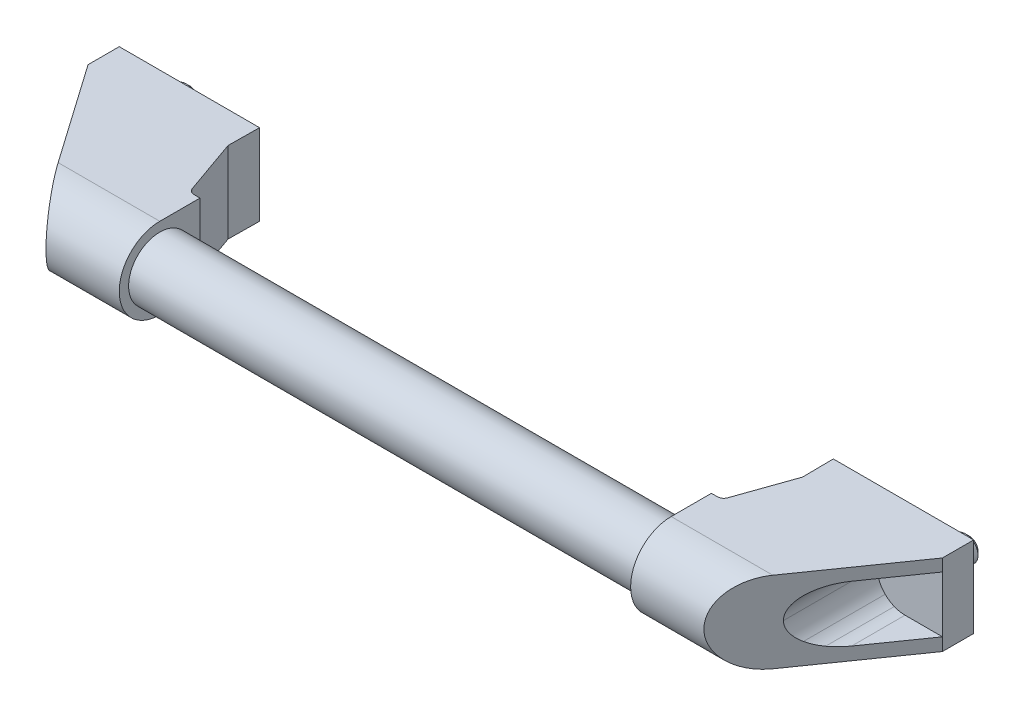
ISO-10303-21;
HEADER;
FILE_DESCRIPTION(('STEP AP214'),'2;1');
FILE_NAME('part.step','',(''),(''),'','','');
FILE_SCHEMA(('AUTOMOTIVE_DESIGN { 1 0 10303 214 1 1 1 1 }'));
ENDSEC;
DATA;
#1=APPLICATION_CONTEXT('core data for automotive mechanical design processes');
#2=APPLICATION_PROTOCOL_DEFINITION('international standard','automotive_design',2000,#1);
#3=PRODUCT_CONTEXT('',#1,'mechanical');
#4=PRODUCT('Part','Part','',(#3));
#5=PRODUCT_RELATED_PRODUCT_CATEGORY('part','',(#4));
#6=PRODUCT_DEFINITION_FORMATION('','',#4);
#7=PRODUCT_DEFINITION_CONTEXT('part definition',#1,'design');
#8=PRODUCT_DEFINITION('design','',#6,#7);
#9=PRODUCT_DEFINITION_SHAPE('','',#8);
#10=(LENGTH_UNIT() NAMED_UNIT(*) SI_UNIT(.MILLI.,.METRE.));
#11=(NAMED_UNIT(*) PLANE_ANGLE_UNIT() SI_UNIT($,.RADIAN.));
#12=(NAMED_UNIT(*) SI_UNIT($,.STERADIAN.) SOLID_ANGLE_UNIT());
#13=UNCERTAINTY_MEASURE_WITH_UNIT(LENGTH_MEASURE(1.E-05),#10,'distance_accuracy_value','');
#14=(GEOMETRIC_REPRESENTATION_CONTEXT(3) GLOBAL_UNCERTAINTY_ASSIGNED_CONTEXT((#13)) GLOBAL_UNIT_ASSIGNED_CONTEXT((#10,
#11,#12)) REPRESENTATION_CONTEXT('',''));
#15=CARTESIAN_POINT('',(0.,0.,0.));
#16=DIRECTION('',(0.,0.,1.));
#17=DIRECTION('',(1.,0.,0.));
#18=AXIS2_PLACEMENT_3D('',#15,#16,#17);
#19=CARTESIAN_POINT('',(-12.,13.,0.));
#20=DIRECTION('',(0.,0.,-1.));
#21=DIRECTION('',(1.,0.,0.));
#22=AXIS2_PLACEMENT_3D('',#19,#20,#21);
#23=PLANE('',#22);
#24=DIRECTION('',(0.,-1.,0.));
#25=VECTOR('',#24,1.);
#26=CARTESIAN_POINT('',(13.,8.,0.));
#27=LINE('',#26,#25);
#28=CARTESIAN_POINT('',(13.,8.,0.));
#29=VERTEX_POINT('',#28);
#30=CARTESIAN_POINT('',(13.,-8.,0.));
#31=VERTEX_POINT('',#30);
#32=EDGE_CURVE('E317',#29,#31,#27,.T.);
#33=ORIENTED_EDGE('',*,*,#32,.T.);
#34=DIRECTION('',(-1.,0.,0.));
#35=VECTOR('',#34,1.);
#36=CARTESIAN_POINT('',(28.,-8.,0.));
#37=LINE('',#36,#35);
#38=CARTESIAN_POINT('',(28.,-8.,0.));
#39=VERTEX_POINT('',#38);
#40=EDGE_CURVE('E304',#39,#31,#37,.T.);
#41=ORIENTED_EDGE('',*,*,#40,.F.);
#42=DIRECTION('',(0.,1.,0.));
#43=VECTOR('',#42,1.);
#44=CARTESIAN_POINT('',(28.,-8.,0.));
#45=LINE('',#44,#43);
#46=CARTESIAN_POINT('',(28.,8.,0.));
#47=VERTEX_POINT('',#46);
#48=EDGE_CURVE('E287',#39,#47,#45,.T.);
#49=ORIENTED_EDGE('',*,*,#48,.T.);
#50=DIRECTION('',(1.,0.,0.));
#51=VECTOR('',#50,1.);
#52=CARTESIAN_POINT('',(13.,8.,0.));
#53=LINE('',#52,#51);
#54=EDGE_CURVE('E301',#29,#47,#53,.T.);
#55=ORIENTED_EDGE('',*,*,#54,.F.);
#56=EDGE_LOOP('',(#33,#41,#49,#55));
#57=FACE_BOUND('',#56,.T.);
#58=DIRECTION('',(0.,1.,0.));
#59=VECTOR('',#58,1.);
#60=CARTESIAN_POINT('',(33.,-13.,0.));
#61=LINE('',#60,#59);
#62=CARTESIAN_POINT('',(33.,-13.,0.));
#63=VERTEX_POINT('',#62);
#64=CARTESIAN_POINT('',(33.,13.,0.));
#65=VERTEX_POINT('',#64);
#66=EDGE_CURVE('E410',#63,#65,#61,.T.);
#67=ORIENTED_EDGE('',*,*,#66,.F.);
#68=DIRECTION('',(1.,0.,0.));
#69=VECTOR('',#68,1.);
#70=CARTESIAN_POINT('',(-12.,-13.,0.));
#71=LINE('',#70,#69);
#72=CARTESIAN_POINT('',(-12.,-13.,0.));
#73=VERTEX_POINT('',#72);
#74=EDGE_CURVE('E444',#73,#63,#71,.T.);
#75=ORIENTED_EDGE('',*,*,#74,.F.);
#76=DIRECTION('',(0.,-1.,0.));
#77=VECTOR('',#76,1.);
#78=CARTESIAN_POINT('',(-12.,13.,0.));
#79=LINE('',#78,#77);
#80=CARTESIAN_POINT('',(-12.,13.,0.));
#81=VERTEX_POINT('',#80);
#82=EDGE_CURVE('E436',#81,#73,#79,.T.);
#83=ORIENTED_EDGE('',*,*,#82,.F.);
#84=DIRECTION('',(1.,0.,0.));
#85=VECTOR('',#84,1.);
#86=CARTESIAN_POINT('',(-12.,13.,0.));
#87=LINE('',#86,#85);
#88=EDGE_CURVE('E441',#81,#65,#87,.T.);
#89=ORIENTED_EDGE('',*,*,#88,.T.);
#90=EDGE_LOOP('',(#67,#75,#83,#89));
#91=FACE_BOUND('',#90,.T.);
#92=CARTESIAN_POINT('',(0.,0.,0.));
#93=DIRECTION('',(0.,0.,-1.));
#94=DIRECTION('',(-1.,0.,0.));
#95=AXIS2_PLACEMENT_3D('',#92,#93,#94);
#96=CIRCLE('',#95,4.);
#97=CARTESIAN_POINT('',(-4.,0.,0.));
#98=VERTEX_POINT('',#97);
#99=EDGE_CURVE('E1261',#98,#98,#96,.T.);
#100=ORIENTED_EDGE('',*,*,#99,.F.);
#101=EDGE_LOOP('',(#100));
#102=FACE_BOUND('',#101,.T.);
#103=ADVANCED_FACE('F14',(#57,#91,#102),#23,.T.);
#104=CARTESIAN_POINT('',(-12.,-13.,10.));
#105=DIRECTION('',(0.819152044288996,0.,-0.573576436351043));
#106=DIRECTION('',(0.573576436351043,0.,0.819152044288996));
#107=AXIS2_PLACEMENT_3D('',#104,#105,#106);
#108=PLANE('',#107);
#109=DIRECTION('',(-0.573576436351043,0.,-0.819152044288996));
#110=VECTOR('',#109,1.);
#111=CARTESIAN_POINT('',(-12.,-8.90119415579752,10.));
#112=LINE('',#111,#110);
#113=CARTESIAN_POINT('',(7.15225699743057E-06,-8.90119415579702,27.137786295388));
#114=VERTEX_POINT('',#113);
#115=CARTESIAN_POINT('',(-12.,-8.90119415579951,10.));
#116=VERTEX_POINT('',#115);
#117=EDGE_CURVE('E472',#114,#116,#112,.T.);
#118=ORIENTED_EDGE('',*,*,#117,.T.);
#119=DIRECTION('',(0.,1.,0.));
#120=VECTOR('',#119,1.);
#121=CARTESIAN_POINT('',(-12.,-13.,10.));
#122=LINE('',#121,#120);
#123=CARTESIAN_POINT('',(-12.,-13.,10.));
#124=VERTEX_POINT('',#123);
#125=EDGE_CURVE('E420',#124,#116,#122,.T.);
#126=ORIENTED_EDGE('',*,*,#125,.F.);
#127=DIRECTION('',(0.573576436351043,0.,0.819152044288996));
#128=VECTOR('',#127,1.);
#129=CARTESIAN_POINT('',(-12.,-13.,10.));
#130=LINE('',#129,#128);
#131=CARTESIAN_POINT('',(10.40664122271,-13.,42.));
#132=VERTEX_POINT('',#131);
#133=EDGE_CURVE('E416',#124,#132,#130,.T.);
#134=ORIENTED_EDGE('',*,*,#133,.T.);
#135=CARTESIAN_POINT('',(10.40664122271,0.,42.));
#136=DIRECTION('',(-0.819152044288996,0.,0.573576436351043));
#137=DIRECTION('',(0.573576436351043,0.,0.819152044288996));
#138=AXIS2_PLACEMENT_3D('',#135,#136,#137);
#139=ELLIPSE('',#138,15.8700696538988,13.);
#140=CARTESIAN_POINT('',(10.40664122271,13.,42.));
#141=VERTEX_POINT('',#140);
#142=EDGE_CURVE('E423',#132,#141,#139,.T.);
#143=ORIENTED_EDGE('',*,*,#142,.T.);
#144=DIRECTION('',(0.573576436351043,0.,0.819152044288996));
#145=VECTOR('',#144,1.);
#146=CARTESIAN_POINT('',(-12.,13.,10.));
#147=LINE('',#146,#145);
#148=CARTESIAN_POINT('',(-12.,13.,10.));
#149=VERTEX_POINT('',#148);
#150=EDGE_CURVE('E413',#149,#141,#147,.T.);
#151=ORIENTED_EDGE('',*,*,#150,.F.);
#152=CARTESIAN_POINT('',(-12.,9.09880893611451,10.));
#153=VERTEX_POINT('',#152);
#154=EDGE_CURVE('E419',#153,#149,#122,.T.);
#155=ORIENTED_EDGE('',*,*,#154,.F.);
#156=DIRECTION('',(-0.573576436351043,0.,-0.819152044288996));
#157=VECTOR('',#156,1.);
#158=CARTESIAN_POINT('',(-12.,9.09880893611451,10.));
#159=LINE('',#158,#157);
#160=CARTESIAN_POINT('',(0.,9.09880893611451,27.1377760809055));
#161=VERTEX_POINT('',#160);
#162=EDGE_CURVE('E451',#161,#153,#159,.T.);
#163=ORIENTED_EDGE('',*,*,#162,.F.);
#164=CARTESIAN_POINT('',(-6.61501451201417E-06,0.098772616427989,27.1377666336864));
#165=DIRECTION('',(-0.819152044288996,0.,0.573576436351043));
#166=DIRECTION('',(0.573576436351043,0.,0.819152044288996));
#167=AXIS2_PLACEMENT_3D('',#164,#165,#166);
#168=ELLIPSE('',#167,15.691084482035,9.0000363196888);
#169=CARTESIAN_POINT('',(3.44415099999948,8.4137249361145,32.0565334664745));
#170=VERTEX_POINT('',#169);
#171=EDGE_CURVE('E454',#170,#161,#168,.T.);
#172=ORIENTED_EDGE('',*,*,#171,.F.);
#173=CARTESIAN_POINT('',(-2.10368275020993E-05,0.0987787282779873,27.1377460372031));
#174=DIRECTION('',(-0.819152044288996,0.,0.573576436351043));
#175=DIRECTION('',(0.573576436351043,0.,0.819152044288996));
#176=AXIS2_PLACEMENT_3D('',#173,#174,#175);
#177=ELLIPSE('',#176,15.6910842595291,9.00003619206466);
#178=CARTESIAN_POINT('',(6.36396099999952,6.4627699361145,36.22645429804));
#179=VERTEX_POINT('',#178);
#180=EDGE_CURVE('E457',#179,#170,#177,.T.);
#181=ORIENTED_EDGE('',*,*,#180,.F.);
#182=CARTESIAN_POINT('',(-3.07078369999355E-05,0.098790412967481,27.13773222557));
#183=DIRECTION('',(-0.819152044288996,0.,0.573576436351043));
#184=DIRECTION('',(0.573576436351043,0.,0.819152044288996));
#185=AXIS2_PLACEMENT_3D('',#182,#183,#184);
#186=ELLIPSE('',#185,15.6910817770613,9.00003476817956);
#187=CARTESIAN_POINT('',(9.00000406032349,0.0988089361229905,39.9911139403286));
#188=VERTEX_POINT('',#187);
#189=EDGE_CURVE('E460',#188,#179,#186,.T.);
#190=ORIENTED_EDGE('',*,*,#189,.F.);
#191=CARTESIAN_POINT('',(-3.27593624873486E-05,0.0988180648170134,27.1377292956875));
#192=DIRECTION('',(-0.819152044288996,0.,0.573576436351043));
#193=DIRECTION('',(0.573576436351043,0.,0.819152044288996));
#194=AXIS2_PLACEMENT_3D('',#191,#192,#193);
#195=ELLIPSE('',#194,15.6910853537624,9.00003681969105);
#196=CARTESIAN_POINT('',(6.36396815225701,-6.26515515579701,36.2264645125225));
#197=VERTEX_POINT('',#196);
#198=EDGE_CURVE('E463',#197,#188,#195,.T.);
#199=ORIENTED_EDGE('',*,*,#198,.F.);
#200=CARTESIAN_POINT('',(-1.38845694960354E-05,0.0988360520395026,27.1377562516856));
#201=DIRECTION('',(-0.819152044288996,0.,0.573576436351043));
#202=DIRECTION('',(0.573576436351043,0.,0.819152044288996));
#203=AXIS2_PLACEMENT_3D('',#200,#201,#202);
#204=ELLIPSE('',#203,15.6910842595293,9.00003619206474);
#205=CARTESIAN_POINT('',(3.44415815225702,-8.21611015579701,32.0565436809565));
#206=VERTEX_POINT('',#205);
#207=EDGE_CURVE('E466',#206,#197,#204,.T.);
#208=ORIENTED_EDGE('',*,*,#207,.F.);
#209=CARTESIAN_POINT('',(5.37243026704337E-07,0.0988421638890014,27.1377768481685));
#210=DIRECTION('',(-0.819152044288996,0.,0.573576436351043));
#211=DIRECTION('',(0.573576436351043,0.,0.819152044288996));
#212=AXIS2_PLACEMENT_3D('',#209,#210,#211);
#213=ELLIPSE('',#212,15.6910844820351,9.00003631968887);
#214=EDGE_CURVE('E469',#114,#206,#213,.T.);
#215=ORIENTED_EDGE('',*,*,#214,.F.);
#216=EDGE_LOOP('',(#118,#126,#134,#143,#151,#155,#163,#172,#181,#190,#199,#208,#215));
#217=FACE_BOUND('',#216,.T.);
#218=ADVANCED_FACE('F726',(#217),#108,.F.);
#219=CARTESIAN_POINT('',(-12.,13.,42.));
#220=DIRECTION('',(0.,1.,0.));
#221=DIRECTION('',(1.,0.,0.));
#222=AXIS2_PLACEMENT_3D('',#219,#220,#221);
#223=PLANE('',#222);
#224=DIRECTION('',(0.0104830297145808,0.,-0.999945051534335));
#225=VECTOR('',#224,1.);
#226=CARTESIAN_POINT('',(32.895169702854,13.,9.99945051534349));
#227=LINE('',#226,#225);
#228=CARTESIAN_POINT('',(32.895169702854,13.,9.99945051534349));
#229=VERTEX_POINT('',#228);
#230=EDGE_CURVE('E388',#229,#65,#227,.T.);
#231=ORIENTED_EDGE('',*,*,#230,.T.);
#232=ORIENTED_EDGE('',*,*,#88,.F.);
#233=DIRECTION('',(0.,0.,-1.));
#234=VECTOR('',#233,1.);
#235=CARTESIAN_POINT('',(-12.,13.,42.));
#236=LINE('',#235,#234);
#237=EDGE_CURVE('E434',#149,#81,#236,.T.);
#238=ORIENTED_EDGE('',*,*,#237,.F.);
#239=ORIENTED_EDGE('',*,*,#150,.T.);
#240=DIRECTION('',(1.,0.,0.));
#241=VECTOR('',#240,1.);
#242=CARTESIAN_POINT('',(-12.,13.,42.));
#243=LINE('',#242,#241);
#244=CARTESIAN_POINT('',(43.,13.,42.));
#245=VERTEX_POINT('',#244);
#246=EDGE_CURVE('E449',#141,#245,#243,.T.);
#247=ORIENTED_EDGE('',*,*,#246,.T.);
#248=DIRECTION('',(0.,0.,-1.));
#249=VECTOR('',#248,1.);
#250=CARTESIAN_POINT('',(43.,13.,42.));
#251=LINE('',#250,#249);
#252=CARTESIAN_POINT('',(43.,13.,29.106429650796));
#253=VERTEX_POINT('',#252);
#254=EDGE_CURVE('E425',#245,#253,#251,.T.);
#255=ORIENTED_EDGE('',*,*,#254,.T.);
#256=DIRECTION('',(-0.999945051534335,0.,-0.0104830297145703));
#257=VECTOR('',#256,1.);
#258=CARTESIAN_POINT('',(43.,13.,29.106429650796));
#259=LINE('',#258,#257);
#260=CARTESIAN_POINT('',(41.0113841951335,13.,29.0855817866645));
#261=VERTEX_POINT('',#260);
#262=EDGE_CURVE('E379',#253,#261,#259,.T.);
#263=ORIENTED_EDGE('',*,*,#262,.T.);
#264=CARTESIAN_POINT('',(41.0323502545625,13.,27.085691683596));
#265=DIRECTION('',(0.,-1.,0.));
#266=DIRECTION('',(1.,0.,0.));
#267=AXIS2_PLACEMENT_3D('',#264,#265,#266);
#268=CIRCLE('',#267,2.);
#269=CARTESIAN_POINT('',(39.1458974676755,13.,27.7499927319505));
#270=VERTEX_POINT('',#269);
#271=EDGE_CURVE('E382',#261,#270,#268,.T.);
#272=ORIENTED_EDGE('',*,*,#271,.T.);
#273=DIRECTION('',(0.332150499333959,0.,0.943226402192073));
#274=VECTOR('',#273,1.);
#275=CARTESIAN_POINT('',(32.895169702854,13.,9.99945051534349));
#276=LINE('',#275,#274);
#277=EDGE_CURVE('E385',#229,#270,#276,.T.);
#278=ORIENTED_EDGE('',*,*,#277,.F.);
#279=EDGE_LOOP('',(#231,#232,#238,#239,#247,#255,#263,#272,#278));
#280=FACE_BOUND('',#279,.T.);
#281=ADVANCED_FACE('F732',(#280),#223,.T.);
#282=CARTESIAN_POINT('',(-12.,0.,42.));
#283=DIRECTION('',(1.,0.,0.));
#284=DIRECTION('',(0.,-1.,0.));
#285=AXIS2_PLACEMENT_3D('',#282,#283,#284);
#286=CYLINDRICAL_SURFACE('',#285,13.);
#287=ORIENTED_EDGE('',*,*,#142,.F.);
#288=DIRECTION('',(1.,0.,0.));
#289=VECTOR('',#288,1.);
#290=CARTESIAN_POINT('',(-12.,-13.,42.));
#291=LINE('',#290,#289);
#292=CARTESIAN_POINT('',(43.,-13.,42.));
#293=VERTEX_POINT('',#292);
#294=EDGE_CURVE('E447',#132,#293,#291,.T.);
#295=ORIENTED_EDGE('',*,*,#294,.T.);
#296=CARTESIAN_POINT('',(43.,0.,42.));
#297=DIRECTION('',(1.,0.,0.));
#298=DIRECTION('',(0.,1.,0.));
#299=AXIS2_PLACEMENT_3D('',#296,#297,#298);
#300=CIRCLE('',#299,13.);
#301=EDGE_CURVE('E431',#245,#293,#300,.T.);
#302=ORIENTED_EDGE('',*,*,#301,.F.);
#303=ORIENTED_EDGE('',*,*,#246,.F.);
#304=EDGE_LOOP('',(#287,#295,#302,#303));
#305=FACE_BOUND('',#304,.T.);
#306=ADVANCED_FACE('F742',(#305),#286,.T.);
#307=CARTESIAN_POINT('',(-12.,-13.,42.));
#308=DIRECTION('',(0.,1.,0.));
#309=DIRECTION('',(1.,0.,0.));
#310=AXIS2_PLACEMENT_3D('',#307,#308,#309);
#311=PLANE('',#310);
#312=DIRECTION('',(0.332150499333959,0.,0.943226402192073));
#313=VECTOR('',#312,1.);
#314=CARTESIAN_POINT('',(32.895169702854,-13.,9.99945051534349));
#315=LINE('',#314,#313);
#316=CARTESIAN_POINT('',(32.895169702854,-13.,9.99945051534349));
#317=VERTEX_POINT('',#316);
#318=CARTESIAN_POINT('',(39.1458974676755,-13.,27.7499927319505));
#319=VERTEX_POINT('',#318);
#320=EDGE_CURVE('E396',#317,#319,#315,.T.);
#321=ORIENTED_EDGE('',*,*,#320,.T.);
#322=CARTESIAN_POINT('',(41.0323502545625,-13.,27.085691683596));
#323=DIRECTION('',(0.,-1.,0.));
#324=DIRECTION('',(1.,0.,0.));
#325=AXIS2_PLACEMENT_3D('',#322,#323,#324);
#326=CIRCLE('',#325,2.);
#327=CARTESIAN_POINT('',(41.0113841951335,-13.,29.0855817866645));
#328=VERTEX_POINT('',#327);
#329=EDGE_CURVE('E393',#328,#319,#326,.T.);
#330=ORIENTED_EDGE('',*,*,#329,.F.);
#331=DIRECTION('',(-0.999945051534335,0.,-0.0104830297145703));
#332=VECTOR('',#331,1.);
#333=CARTESIAN_POINT('',(43.,-13.,29.106429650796));
#334=LINE('',#333,#332);
#335=CARTESIAN_POINT('',(43.,-13.,29.106429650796));
#336=VERTEX_POINT('',#335);
#337=EDGE_CURVE('E390',#336,#328,#334,.T.);
#338=ORIENTED_EDGE('',*,*,#337,.F.);
#339=DIRECTION('',(0.,0.,-1.));
#340=VECTOR('',#339,1.);
#341=CARTESIAN_POINT('',(43.,-13.,42.));
#342=LINE('',#341,#340);
#343=EDGE_CURVE('E428',#293,#336,#342,.T.);
#344=ORIENTED_EDGE('',*,*,#343,.F.);
#345=ORIENTED_EDGE('',*,*,#294,.F.);
#346=ORIENTED_EDGE('',*,*,#133,.F.);
#347=DIRECTION('',(0.,0.,-1.));
#348=VECTOR('',#347,1.);
#349=CARTESIAN_POINT('',(-12.,-13.,42.));
#350=LINE('',#349,#348);
#351=EDGE_CURVE('E439',#124,#73,#350,.T.);
#352=ORIENTED_EDGE('',*,*,#351,.T.);
#353=ORIENTED_EDGE('',*,*,#74,.T.);
#354=DIRECTION('',(0.0104830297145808,0.,-0.999945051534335));
#355=VECTOR('',#354,1.);
#356=CARTESIAN_POINT('',(32.895169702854,-13.,9.99945051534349));
#357=LINE('',#356,#355);
#358=EDGE_CURVE('E399',#317,#63,#357,.T.);
#359=ORIENTED_EDGE('',*,*,#358,.F.);
#360=EDGE_LOOP('',(#321,#330,#338,#344,#345,#346,#352,#353,#359));
#361=FACE_BOUND('',#360,.T.);
#362=ADVANCED_FACE('F738',(#361),#311,.F.);
#363=CARTESIAN_POINT('',(-12.,0.,42.));
#364=DIRECTION('',(-1.,0.,0.));
#365=DIRECTION('',(0.,1.,0.));
#366=AXIS2_PLACEMENT_3D('',#363,#364,#365);
#367=PLANE('',#366);
#368=ORIENTED_EDGE('',*,*,#125,.T.);
#369=DIRECTION('',(0.,1.,0.));
#370=VECTOR('',#369,1.);
#371=CARTESIAN_POINT('',(-12.,-8.90119415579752,10.));
#372=LINE('',#371,#370);
#373=EDGE_CURVE('E355',#116,#153,#372,.T.);
#374=ORIENTED_EDGE('',*,*,#373,.T.);
#375=ORIENTED_EDGE('',*,*,#154,.T.);
#376=ORIENTED_EDGE('',*,*,#237,.T.);
#377=ORIENTED_EDGE('',*,*,#82,.T.);
#378=ORIENTED_EDGE('',*,*,#351,.F.);
#379=EDGE_LOOP('',(#368,#374,#375,#376,#377,#378));
#380=FACE_BOUND('',#379,.T.);
#381=ADVANCED_FACE('F741',(#380),#367,.T.);
#382=CARTESIAN_POINT('',(43.,0.,42.));
#383=DIRECTION('',(-1.,0.,0.));
#384=DIRECTION('',(0.,1.,0.));
#385=AXIS2_PLACEMENT_3D('',#382,#383,#384);
#386=PLANE('',#385);
#387=DIRECTION('',(0.,1.,0.));
#388=VECTOR('',#387,1.);
#389=CARTESIAN_POINT('',(43.,-13.,29.106429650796));
#390=LINE('',#389,#388);
#391=EDGE_CURVE('E402',#336,#253,#390,.T.);
#392=ORIENTED_EDGE('',*,*,#391,.T.);
#393=ORIENTED_EDGE('',*,*,#254,.F.);
#394=ORIENTED_EDGE('',*,*,#301,.T.);
#395=ORIENTED_EDGE('',*,*,#343,.T.);
#396=EDGE_LOOP('',(#392,#393,#394,#395));
#397=FACE_BOUND('',#396,.T.);
#398=CARTESIAN_POINT('',(43.,0.,42.));
#399=DIRECTION('',(-1.,0.,0.));
#400=DIRECTION('',(0.,0.,1.));
#401=AXIS2_PLACEMENT_3D('',#398,#399,#400);
#402=CIRCLE('',#401,10.);
#403=CARTESIAN_POINT('',(43.,0.,52.));
#404=VERTEX_POINT('',#403);
#405=EDGE_CURVE('E1257',#404,#404,#402,.T.);
#406=ORIENTED_EDGE('',*,*,#405,.T.);
#407=EDGE_LOOP('',(#406));
#408=FACE_BOUND('',#407,.T.);
#409=ADVANCED_FACE('F1200',(#397,#408),#386,.F.);
#410=CARTESIAN_POINT('',(32.895169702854,-13.,9.99945051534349));
#411=DIRECTION('',(-0.999945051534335,0.,-0.0104830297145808));
#412=DIRECTION('',(0.0104830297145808,0.,-0.999945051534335));
#413=AXIS2_PLACEMENT_3D('',#410,#411,#412);
#414=PLANE('',#413);
#415=DIRECTION('',(0.,1.,0.));
#416=VECTOR('',#415,1.);
#417=CARTESIAN_POINT('',(32.895169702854,-13.,9.99945051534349));
#418=LINE('',#417,#416);
#419=EDGE_CURVE('E408',#317,#229,#418,.T.);
#420=ORIENTED_EDGE('',*,*,#419,.F.);
#421=ORIENTED_EDGE('',*,*,#358,.T.);
#422=ORIENTED_EDGE('',*,*,#66,.T.);
#423=ORIENTED_EDGE('',*,*,#230,.F.);
#424=EDGE_LOOP('',(#420,#421,#422,#423));
#425=FACE_BOUND('',#424,.T.);
#426=ADVANCED_FACE('F1191',(#425),#414,.F.);
#427=CARTESIAN_POINT('',(32.895169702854,-13.,9.99945051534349));
#428=DIRECTION('',(0.943226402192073,0.,-0.332150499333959));
#429=DIRECTION('',(0.332150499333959,0.,0.943226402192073));
#430=AXIS2_PLACEMENT_3D('',#427,#428,#429);
#431=PLANE('',#430);
#432=DIRECTION('',(0.,1.,0.));
#433=VECTOR('',#432,1.);
#434=CARTESIAN_POINT('',(39.1458974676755,-13.,27.7499927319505));
#435=LINE('',#434,#433);
#436=EDGE_CURVE('E406',#319,#270,#435,.T.);
#437=ORIENTED_EDGE('',*,*,#436,.F.);
#438=ORIENTED_EDGE('',*,*,#320,.F.);
#439=ORIENTED_EDGE('',*,*,#419,.T.);
#440=ORIENTED_EDGE('',*,*,#277,.T.);
#441=EDGE_LOOP('',(#437,#438,#439,#440));
#442=FACE_BOUND('',#441,.T.);
#443=ADVANCED_FACE('F1182',(#442),#431,.T.);
#444=CARTESIAN_POINT('',(41.0323502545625,-13.,27.085691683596));
#445=DIRECTION('',(0.,1.,0.));
#446=DIRECTION('',(1.,0.,0.));
#447=AXIS2_PLACEMENT_3D('',#444,#445,#446);
#448=CYLINDRICAL_SURFACE('',#447,2.);
#449=DIRECTION('',(0.,1.,0.));
#450=VECTOR('',#449,1.);
#451=CARTESIAN_POINT('',(41.0113841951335,-13.,29.0855817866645));
#452=LINE('',#451,#450);
#453=EDGE_CURVE('E404',#328,#261,#452,.T.);
#454=ORIENTED_EDGE('',*,*,#453,.F.);
#455=ORIENTED_EDGE('',*,*,#329,.T.);
#456=ORIENTED_EDGE('',*,*,#436,.T.);
#457=ORIENTED_EDGE('',*,*,#271,.F.);
#458=EDGE_LOOP('',(#454,#455,#456,#457));
#459=FACE_BOUND('',#458,.T.);
#460=ADVANCED_FACE('F1173',(#459),#448,.F.);
#461=CARTESIAN_POINT('',(43.,-13.,29.106429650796));
#462=DIRECTION('',(-0.0104830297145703,0.,0.999945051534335));
#463=DIRECTION('',(-0.999945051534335,0.,-0.0104830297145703));
#464=AXIS2_PLACEMENT_3D('',#461,#462,#463);
#465=PLANE('',#464);
#466=ORIENTED_EDGE('',*,*,#391,.F.);
#467=ORIENTED_EDGE('',*,*,#337,.T.);
#468=ORIENTED_EDGE('',*,*,#453,.T.);
#469=ORIENTED_EDGE('',*,*,#262,.F.);
#470=EDGE_LOOP('',(#466,#467,#468,#469));
#471=FACE_BOUND('',#470,.T.);
#472=ADVANCED_FACE('F1164',(#471),#465,.F.);
#473=CARTESIAN_POINT('',(-12.,-8.90119415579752,10.));
#474=DIRECTION('',(0.,1.,0.));
#475=DIRECTION('',(1.,0.,0.));
#476=AXIS2_PLACEMENT_3D('',#473,#474,#475);
#477=PLANE('',#476);
#478=ORIENTED_EDGE('',*,*,#117,.F.);
#479=DIRECTION('',(0.,0.,1.));
#480=VECTOR('',#479,1.);
#481=CARTESIAN_POINT('',(7.1522570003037E-06,-8.90119415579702,10.));
#482=LINE('',#481,#480);
#483=CARTESIAN_POINT('',(7.1522570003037E-06,-8.90119415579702,10.));
#484=VERTEX_POINT('',#483);
#485=EDGE_CURVE('E376',#484,#114,#482,.T.);
#486=ORIENTED_EDGE('',*,*,#485,.F.);
#487=DIRECTION('',(1.,0.,0.));
#488=VECTOR('',#487,1.);
#489=CARTESIAN_POINT('',(-12.,-8.90119415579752,10.));
#490=LINE('',#489,#488);
#491=EDGE_CURVE('E294',#116,#484,#490,.T.);
#492=ORIENTED_EDGE('',*,*,#491,.F.);
#493=EDGE_LOOP('',(#478,#486,#492));
#494=FACE_BOUND('',#493,.T.);
#495=ADVANCED_FACE('F1155',(#494),#477,.T.);
#496=CARTESIAN_POINT('',(5.37243021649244E-07,0.0988421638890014,10.));
#497=DIRECTION('',(0.,0.,1.));
#498=DIRECTION('',(-1.,0.,0.));
#499=AXIS2_PLACEMENT_3D('',#496,#497,#498);
#500=CYLINDRICAL_SURFACE('',#499,9.00003631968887);
#501=ORIENTED_EDGE('',*,*,#485,.T.);
#502=ORIENTED_EDGE('',*,*,#214,.T.);
#503=DIRECTION('',(0.,0.,1.));
#504=VECTOR('',#503,1.);
#505=CARTESIAN_POINT('',(3.44415815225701,-8.21611015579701,10.));
#506=LINE('',#505,#504);
#507=CARTESIAN_POINT('',(3.44415815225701,-8.21611015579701,10.));
#508=VERTEX_POINT('',#507);
#509=EDGE_CURVE('E373',#508,#206,#506,.T.);
#510=ORIENTED_EDGE('',*,*,#509,.F.);
#511=CARTESIAN_POINT('',(5.37243021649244E-07,0.0988421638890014,10.));
#512=DIRECTION('',(0.,0.,-1.));
#513=DIRECTION('',(-1.,0.,0.));
#514=AXIS2_PLACEMENT_3D('',#511,#512,#513);
#515=CIRCLE('',#514,9.00003631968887);
#516=EDGE_CURVE('E334',#508,#484,#515,.T.);
#517=ORIENTED_EDGE('',*,*,#516,.T.);
#518=EDGE_LOOP('',(#501,#502,#510,#517));
#519=FACE_BOUND('',#518,.T.);
#520=ADVANCED_FACE('F1146',(#519),#500,.F.);
#521=CARTESIAN_POINT('',(-1.38845694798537E-05,0.0988360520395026,10.));
#522=DIRECTION('',(0.,0.,1.));
#523=DIRECTION('',(-1.,0.,0.));
#524=AXIS2_PLACEMENT_3D('',#521,#522,#523);
#525=CYLINDRICAL_SURFACE('',#524,9.00003619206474);
#526=ORIENTED_EDGE('',*,*,#509,.T.);
#527=ORIENTED_EDGE('',*,*,#207,.T.);
#528=DIRECTION('',(0.,0.,1.));
#529=VECTOR('',#528,1.);
#530=CARTESIAN_POINT('',(6.363968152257,-6.26515515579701,10.));
#531=LINE('',#530,#529);
#532=CARTESIAN_POINT('',(6.363968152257,-6.26515515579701,10.));
#533=VERTEX_POINT('',#532);
#534=EDGE_CURVE('E370',#533,#197,#531,.T.);
#535=ORIENTED_EDGE('',*,*,#534,.F.);
#536=CARTESIAN_POINT('',(-1.38845694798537E-05,0.0988360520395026,10.));
#537=DIRECTION('',(0.,0.,-1.));
#538=DIRECTION('',(-1.,0.,0.));
#539=AXIS2_PLACEMENT_3D('',#536,#537,#538);
#540=CIRCLE('',#539,9.00003619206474);
#541=EDGE_CURVE('E337',#533,#508,#540,.T.);
#542=ORIENTED_EDGE('',*,*,#541,.T.);
#543=EDGE_LOOP('',(#526,#527,#535,#542));
#544=FACE_BOUND('',#543,.T.);
#545=ADVANCED_FACE('F1137',(#544),#525,.F.);
#546=CARTESIAN_POINT('',(-3.27593624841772E-05,0.0988180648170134,10.));
#547=DIRECTION('',(0.,0.,1.));
#548=DIRECTION('',(-1.,0.,0.));
#549=AXIS2_PLACEMENT_3D('',#546,#547,#548);
#550=CYLINDRICAL_SURFACE('',#549,9.00003681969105);
#551=ORIENTED_EDGE('',*,*,#534,.T.);
#552=ORIENTED_EDGE('',*,*,#198,.T.);
#553=DIRECTION('',(0.,0.,1.));
#554=VECTOR('',#553,1.);
#555=CARTESIAN_POINT('',(9.00000406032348,0.0988089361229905,10.));
#556=LINE('',#555,#554);
#557=CARTESIAN_POINT('',(9.00000406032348,0.0988089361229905,10.));
#558=VERTEX_POINT('',#557);
#559=EDGE_CURVE('E367',#558,#188,#556,.T.);
#560=ORIENTED_EDGE('',*,*,#559,.F.);
#561=CARTESIAN_POINT('',(-3.27593624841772E-05,0.0988180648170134,10.));
#562=DIRECTION('',(0.,0.,-1.));
#563=DIRECTION('',(-1.,0.,0.));
#564=AXIS2_PLACEMENT_3D('',#561,#562,#563);
#565=CIRCLE('',#564,9.00003681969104);
#566=EDGE_CURVE('E340',#558,#533,#565,.T.);
#567=ORIENTED_EDGE('',*,*,#566,.T.);
#568=EDGE_LOOP('',(#551,#552,#560,#567));
#569=FACE_BOUND('',#568,.T.);
#570=ADVANCED_FACE('F1128',(#569),#550,.F.);
#571=CARTESIAN_POINT('',(-3.07078369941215E-05,0.098790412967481,10.));
#572=DIRECTION('',(0.,0.,1.));
#573=DIRECTION('',(-1.,0.,0.));
#574=AXIS2_PLACEMENT_3D('',#571,#572,#573);
#575=CYLINDRICAL_SURFACE('',#574,9.00003476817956);
#576=ORIENTED_EDGE('',*,*,#559,.T.);
#577=ORIENTED_EDGE('',*,*,#189,.T.);
#578=DIRECTION('',(0.,0.,1.));
#579=VECTOR('',#578,1.);
#580=CARTESIAN_POINT('',(6.36396099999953,6.4627699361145,10.));
#581=LINE('',#580,#579);
#582=CARTESIAN_POINT('',(6.36396099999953,6.4627699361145,10.));
#583=VERTEX_POINT('',#582);
#584=EDGE_CURVE('E364',#583,#179,#581,.T.);
#585=ORIENTED_EDGE('',*,*,#584,.F.);
#586=CARTESIAN_POINT('',(-3.07078369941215E-05,0.098790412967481,10.));
#587=DIRECTION('',(0.,0.,-1.));
#588=DIRECTION('',(-1.,0.,0.));
#589=AXIS2_PLACEMENT_3D('',#586,#587,#588);
#590=CIRCLE('',#589,9.00003476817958);
#591=EDGE_CURVE('E343',#583,#558,#590,.T.);
#592=ORIENTED_EDGE('',*,*,#591,.T.);
#593=EDGE_LOOP('',(#576,#577,#585,#592));
#594=FACE_BOUND('',#593,.T.);
#595=ADVANCED_FACE('F1119',(#594),#575,.F.);
#596=CARTESIAN_POINT('',(-2.10368275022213E-05,0.0987787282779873,10.));
#597=DIRECTION('',(0.,0.,1.));
#598=DIRECTION('',(-1.,0.,0.));
#599=AXIS2_PLACEMENT_3D('',#596,#597,#598);
#600=CYLINDRICAL_SURFACE('',#599,9.00003619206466);
#601=ORIENTED_EDGE('',*,*,#584,.T.);
#602=ORIENTED_EDGE('',*,*,#180,.T.);
#603=DIRECTION('',(0.,0.,1.));
#604=VECTOR('',#603,1.);
#605=CARTESIAN_POINT('',(3.44415099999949,8.4137249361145,10.));
#606=LINE('',#605,#604);
#607=CARTESIAN_POINT('',(3.44415099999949,8.4137249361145,10.));
#608=VERTEX_POINT('',#607);
#609=EDGE_CURVE('E361',#608,#170,#606,.T.);
#610=ORIENTED_EDGE('',*,*,#609,.F.);
#611=CARTESIAN_POINT('',(-2.10368275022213E-05,0.0987787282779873,10.));
#612=DIRECTION('',(0.,0.,-1.));
#613=DIRECTION('',(-1.,0.,0.));
#614=AXIS2_PLACEMENT_3D('',#611,#612,#613);
#615=CIRCLE('',#614,9.00003619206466);
#616=EDGE_CURVE('E346',#608,#583,#615,.T.);
#617=ORIENTED_EDGE('',*,*,#616,.T.);
#618=EDGE_LOOP('',(#601,#602,#610,#617));
#619=FACE_BOUND('',#618,.T.);
#620=ADVANCED_FACE('F1110',(#619),#600,.F.);
#621=CARTESIAN_POINT('',(-6.61501450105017E-06,0.098772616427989,10.));
#622=DIRECTION('',(0.,0.,1.));
#623=DIRECTION('',(-1.,0.,0.));
#624=AXIS2_PLACEMENT_3D('',#621,#622,#623);
#625=CYLINDRICAL_SURFACE('',#624,9.0000363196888);
#626=ORIENTED_EDGE('',*,*,#609,.T.);
#627=ORIENTED_EDGE('',*,*,#171,.T.);
#628=DIRECTION('',(0.,0.,1.));
#629=VECTOR('',#628,1.);
#630=CARTESIAN_POINT('',(0.,9.09880893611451,10.));
#631=LINE('',#630,#629);
#632=CARTESIAN_POINT('',(0.,9.09880893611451,10.));
#633=VERTEX_POINT('',#632);
#634=EDGE_CURVE('E358',#633,#161,#631,.T.);
#635=ORIENTED_EDGE('',*,*,#634,.F.);
#636=CARTESIAN_POINT('',(-6.61501450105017E-06,0.098772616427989,10.));
#637=DIRECTION('',(0.,0.,-1.));
#638=DIRECTION('',(-1.,0.,0.));
#639=AXIS2_PLACEMENT_3D('',#636,#637,#638);
#640=CIRCLE('',#639,9.0000363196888);
#641=EDGE_CURVE('E349',#633,#608,#640,.T.);
#642=ORIENTED_EDGE('',*,*,#641,.T.);
#643=EDGE_LOOP('',(#626,#627,#635,#642));
#644=FACE_BOUND('',#643,.T.);
#645=ADVANCED_FACE('F1101',(#644),#625,.F.);
#646=CARTESIAN_POINT('',(-12.,9.09880893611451,10.));
#647=DIRECTION('',(0.,1.,0.));
#648=DIRECTION('',(1.,0.,0.));
#649=AXIS2_PLACEMENT_3D('',#646,#647,#648);
#650=PLANE('',#649);
#651=ORIENTED_EDGE('',*,*,#634,.T.);
#652=ORIENTED_EDGE('',*,*,#162,.T.);
#653=DIRECTION('',(1.,0.,0.));
#654=VECTOR('',#653,1.);
#655=CARTESIAN_POINT('',(-12.,9.09880893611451,10.));
#656=LINE('',#655,#654);
#657=EDGE_CURVE('E352',#153,#633,#656,.T.);
#658=ORIENTED_EDGE('',*,*,#657,.T.);
#659=EDGE_LOOP('',(#651,#652,#658));
#660=FACE_BOUND('',#659,.T.);
#661=ADVANCED_FACE('F1092',(#660),#650,.F.);
#662=CARTESIAN_POINT('',(5.37243021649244E-07,0.0988421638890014,10.));
#663=DIRECTION('',(0.,0.,1.));
#664=DIRECTION('',(-1.,0.,0.));
#665=AXIS2_PLACEMENT_3D('',#662,#663,#664);
#666=PLANE('',#665);
#667=ORIENTED_EDGE('',*,*,#491,.T.);
#668=ORIENTED_EDGE('',*,*,#516,.F.);
#669=ORIENTED_EDGE('',*,*,#541,.F.);
#670=ORIENTED_EDGE('',*,*,#566,.F.);
#671=ORIENTED_EDGE('',*,*,#591,.F.);
#672=ORIENTED_EDGE('',*,*,#616,.F.);
#673=ORIENTED_EDGE('',*,*,#641,.F.);
#674=ORIENTED_EDGE('',*,*,#657,.F.);
#675=ORIENTED_EDGE('',*,*,#373,.F.);
#676=EDGE_LOOP('',(#667,#668,#669,#670,#671,#672,#673,#674,#675));
#677=FACE_BOUND('',#676,.T.);
#678=ADVANCED_FACE('F1084',(#677),#666,.T.);
#679=CARTESIAN_POINT('',(13.,8.,30.));
#680=DIRECTION('',(0.,-1.,0.));
#681=DIRECTION('',(-1.,0.,0.));
#682=AXIS2_PLACEMENT_3D('',#679,#680,#681);
#683=PLANE('',#682);
#684=DIRECTION('',(0.,0.,-1.));
#685=VECTOR('',#684,1.);
#686=CARTESIAN_POINT('',(28.,8.,30.));
#687=LINE('',#686,#685);
#688=CARTESIAN_POINT('',(28.,8.,30.));
#689=VERTEX_POINT('',#688);
#690=EDGE_CURVE('E284',#689,#47,#687,.T.);
#691=ORIENTED_EDGE('',*,*,#690,.F.);
#692=DIRECTION('',(1.,0.,0.));
#693=VECTOR('',#692,1.);
#694=CARTESIAN_POINT('',(13.,8.,30.));
#695=LINE('',#694,#693);
#696=CARTESIAN_POINT('',(13.,8.,30.));
#697=VERTEX_POINT('',#696);
#698=EDGE_CURVE('E319',#697,#689,#695,.T.);
#699=ORIENTED_EDGE('',*,*,#698,.F.);
#700=DIRECTION('',(0.,0.,-1.));
#701=VECTOR('',#700,1.);
#702=CARTESIAN_POINT('',(13.,8.,30.));
#703=LINE('',#702,#701);
#704=EDGE_CURVE('E307',#697,#29,#703,.T.);
#705=ORIENTED_EDGE('',*,*,#704,.T.);
#706=ORIENTED_EDGE('',*,*,#54,.T.);
#707=EDGE_LOOP('',(#691,#699,#705,#706));
#708=FACE_BOUND('',#707,.T.);
#709=ADVANCED_FACE('F306',(#708),#683,.T.);
#710=CARTESIAN_POINT('',(28.,-8.,30.));
#711=DIRECTION('',(1.,0.,0.));
#712=DIRECTION('',(0.,-1.,0.));
#713=AXIS2_PLACEMENT_3D('',#710,#711,#712);
#714=PLANE('',#713);
#715=DIRECTION('',(0.,0.,-1.));
#716=VECTOR('',#715,1.);
#717=CARTESIAN_POINT('',(28.,-8.,30.));
#718=LINE('',#717,#716);
#719=CARTESIAN_POINT('',(28.,-8.,30.));
#720=VERTEX_POINT('',#719);
#721=EDGE_CURVE('E295',#720,#39,#718,.T.);
#722=ORIENTED_EDGE('',*,*,#721,.F.);
#723=DIRECTION('',(0.,1.,0.));
#724=VECTOR('',#723,1.);
#725=CARTESIAN_POINT('',(28.,-8.,30.));
#726=LINE('',#725,#724);
#727=EDGE_CURVE('E289',#720,#689,#726,.T.);
#728=ORIENTED_EDGE('',*,*,#727,.T.);
#729=ORIENTED_EDGE('',*,*,#690,.T.);
#730=ORIENTED_EDGE('',*,*,#48,.F.);
#731=EDGE_LOOP('',(#722,#728,#729,#730));
#732=FACE_BOUND('',#731,.T.);
#733=ADVANCED_FACE('F286',(#732),#714,.F.);
#734=CARTESIAN_POINT('',(28.,-8.,30.));
#735=DIRECTION('',(0.,1.,0.));
#736=DIRECTION('',(1.,0.,0.));
#737=AXIS2_PLACEMENT_3D('',#734,#735,#736);
#738=PLANE('',#737);
#739=DIRECTION('',(0.,0.,-1.));
#740=VECTOR('',#739,1.);
#741=CARTESIAN_POINT('',(13.,-8.,30.));
#742=LINE('',#741,#740);
#743=CARTESIAN_POINT('',(13.,-8.,30.));
#744=VERTEX_POINT('',#743);
#745=EDGE_CURVE('E329',#744,#31,#742,.T.);
#746=ORIENTED_EDGE('',*,*,#745,.F.);
#747=DIRECTION('',(-1.,0.,0.));
#748=VECTOR('',#747,1.);
#749=CARTESIAN_POINT('',(28.,-8.,30.));
#750=LINE('',#749,#748);
#751=EDGE_CURVE('E322',#720,#744,#750,.T.);
#752=ORIENTED_EDGE('',*,*,#751,.F.);
#753=ORIENTED_EDGE('',*,*,#721,.T.);
#754=ORIENTED_EDGE('',*,*,#40,.T.);
#755=EDGE_LOOP('',(#746,#752,#753,#754));
#756=FACE_BOUND('',#755,.T.);
#757=ADVANCED_FACE('F1054',(#756),#738,.T.);
#758=CARTESIAN_POINT('',(13.,8.,30.));
#759=DIRECTION('',(-1.,0.,0.));
#760=DIRECTION('',(0.,1.,0.));
#761=AXIS2_PLACEMENT_3D('',#758,#759,#760);
#762=PLANE('',#761);
#763=DIRECTION('',(0.,-1.,0.));
#764=VECTOR('',#763,1.);
#765=CARTESIAN_POINT('',(13.,8.,30.));
#766=LINE('',#765,#764);
#767=EDGE_CURVE('E325',#697,#744,#766,.T.);
#768=ORIENTED_EDGE('',*,*,#767,.T.);
#769=ORIENTED_EDGE('',*,*,#745,.T.);
#770=ORIENTED_EDGE('',*,*,#32,.F.);
#771=ORIENTED_EDGE('',*,*,#704,.F.);
#772=EDGE_LOOP('',(#768,#769,#770,#771));
#773=FACE_BOUND('',#772,.T.);
#774=ADVANCED_FACE('F1045',(#773),#762,.F.);
#775=CARTESIAN_POINT('',(28.,8.,30.));
#776=DIRECTION('',(0.,0.,-1.));
#777=DIRECTION('',(1.,0.,0.));
#778=AXIS2_PLACEMENT_3D('',#775,#776,#777);
#779=PLANE('',#778);
#780=ORIENTED_EDGE('',*,*,#698,.T.);
#781=ORIENTED_EDGE('',*,*,#727,.F.);
#782=ORIENTED_EDGE('',*,*,#751,.T.);
#783=ORIENTED_EDGE('',*,*,#767,.F.);
#784=EDGE_LOOP('',(#780,#781,#782,#783));
#785=FACE_BOUND('',#784,.T.);
#786=ADVANCED_FACE('F1042',(#785),#779,.T.);
#787=CARTESIAN_POINT('',(0.,0.,-10.6));
#788=DIRECTION('',(0.,0.,1.));
#789=DIRECTION('',(-1.,0.,0.));
#790=AXIS2_PLACEMENT_3D('',#787,#788,#789);
#791=PLANE('',#790);
#792=CARTESIAN_POINT('',(0.,0.,-10.6));
#793=DIRECTION('',(0.,0.,-1.));
#794=DIRECTION('',(-1.,0.,0.));
#795=AXIS2_PLACEMENT_3D('',#792,#793,#794);
#796=CIRCLE('',#795,2.8);
#797=CARTESIAN_POINT('',(-2.80000000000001,0.,-10.6));
#798=VERTEX_POINT('',#797);
#799=EDGE_CURVE('E309',#798,#798,#796,.T.);
#800=ORIENTED_EDGE('',*,*,#799,.T.);
#801=EDGE_LOOP('',(#800));
#802=FACE_BOUND('',#801,.T.);
#803=ADVANCED_FACE('F1033',(#802),#791,.F.);
#804=CARTESIAN_POINT('',(0.,0.,-10.6));
#805=DIRECTION('',(0.,0.,1.));
#806=DIRECTION('',(-1.,0.,0.));
#807=AXIS2_PLACEMENT_3D('',#804,#805,#806);
#808=CONICAL_SURFACE('',#807,2.8,0.785398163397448);
#809=CARTESIAN_POINT('',(0.,0.,-9.4));
#810=DIRECTION('',(0.,0.,-1.));
#811=DIRECTION('',(-1.,0.,0.));
#812=AXIS2_PLACEMENT_3D('',#809,#810,#811);
#813=CIRCLE('',#812,4.);
#814=CARTESIAN_POINT('',(-4.00000000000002,0.,-9.4));
#815=VERTEX_POINT('',#814);
#816=EDGE_CURVE('E312',#815,#815,#813,.T.);
#817=ORIENTED_EDGE('',*,*,#816,.T.);
#818=EDGE_LOOP('',(#817));
#819=FACE_BOUND('',#818,.T.);
#820=ORIENTED_EDGE('',*,*,#799,.F.);
#821=EDGE_LOOP('',(#820));
#822=FACE_BOUND('',#821,.T.);
#823=ADVANCED_FACE('F1024',(#819,#822),#808,.T.);
#824=CARTESIAN_POINT('',(0.,0.,27.1377760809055));
#825=DIRECTION('',(0.,0.,1.));
#826=DIRECTION('',(-1.,0.,0.));
#827=AXIS2_PLACEMENT_3D('',#824,#825,#826);
#828=CYLINDRICAL_SURFACE('',#827,4.);
#829=ORIENTED_EDGE('',*,*,#816,.F.);
#830=EDGE_LOOP('',(#829));
#831=FACE_BOUND('',#830,.T.);
#832=ORIENTED_EDGE('',*,*,#99,.T.);
#833=EDGE_LOOP('',(#832));
#834=FACE_BOUND('',#833,.T.);
#835=ADVANCED_FACE('F1016',(#831,#834),#828,.T.);
#836=CARTESIAN_POINT('',(103.927776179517,0.,42.));
#837=DIRECTION('',(-1.,0.,0.));
#838=DIRECTION('',(0.,0.,1.));
#839=AXIS2_PLACEMENT_3D('',#836,#837,#838);
#840=CYLINDRICAL_SURFACE('',#839,10.);
#841=ORIENTED_EDGE('',*,*,#405,.F.);
#842=EDGE_LOOP('',(#841));
#843=FACE_BOUND('',#842,.T.);
#844=CARTESIAN_POINT('',(207.,0.,42.));
#845=DIRECTION('',(-1.,0.,0.));
#846=DIRECTION('',(0.,0.,1.));
#847=AXIS2_PLACEMENT_3D('',#844,#845,#846);
#848=CIRCLE('',#847,10.);
#849=CARTESIAN_POINT('',(207.,0.,52.));
#850=VERTEX_POINT('',#849);
#851=EDGE_CURVE('E1258',#850,#850,#848,.T.);
#852=ORIENTED_EDGE('',*,*,#851,.T.);
#853=EDGE_LOOP('',(#852));
#854=FACE_BOUND('',#853,.T.);
#855=ADVANCED_FACE('F760',(#843,#854),#840,.T.);
#856=CARTESIAN_POINT('',(250.,0.,-10.6));
#857=DIRECTION('',(0.,0.,1.));
#858=DIRECTION('',(1.,0.,0.));
#859=AXIS2_PLACEMENT_3D('',#856,#857,#858);
#860=PLANE('',#859);
#861=CARTESIAN_POINT('',(250.,0.,-10.6));
#862=DIRECTION('',(0.,0.,1.));
#863=DIRECTION('',(1.,0.,0.));
#864=AXIS2_PLACEMENT_3D('',#861,#862,#863);
#865=CIRCLE('',#864,2.8);
#866=CARTESIAN_POINT('',(252.8,0.,-10.6));
#867=VERTEX_POINT('',#866);
#868=EDGE_CURVE('E481',#867,#867,#865,.T.);
#869=ORIENTED_EDGE('',*,*,#868,.F.);
#870=EDGE_LOOP('',(#869));
#871=FACE_BOUND('',#870,.T.);
#872=ADVANCED_FACE('F756',(#871),#860,.F.);
#873=CARTESIAN_POINT('',(250.,0.,-10.6));
#874=DIRECTION('',(0.,0.,1.));
#875=DIRECTION('',(1.,0.,0.));
#876=AXIS2_PLACEMENT_3D('',#873,#874,#875);
#877=CONICAL_SURFACE('',#876,2.8,0.785398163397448);
#878=CARTESIAN_POINT('',(250.,0.,-9.4));
#879=DIRECTION('',(0.,0.,1.));
#880=DIRECTION('',(1.,0.,0.));
#881=AXIS2_PLACEMENT_3D('',#878,#879,#880);
#882=CIRCLE('',#881,4.);
#883=CARTESIAN_POINT('',(254.,0.,-9.4));
#884=VERTEX_POINT('',#883);
#885=EDGE_CURVE('E478',#884,#884,#882,.T.);
#886=ORIENTED_EDGE('',*,*,#885,.F.);
#887=EDGE_LOOP('',(#886));
#888=FACE_BOUND('',#887,.T.);
#889=ORIENTED_EDGE('',*,*,#868,.T.);
#890=EDGE_LOOP('',(#889));
#891=FACE_BOUND('',#890,.T.);
#892=ADVANCED_FACE('F753',(#888,#891),#877,.T.);
#893=CARTESIAN_POINT('',(222.,8.,30.));
#894=DIRECTION('',(0.,0.,-1.));
#895=DIRECTION('',(-1.,0.,0.));
#896=AXIS2_PLACEMENT_3D('',#893,#894,#895);
#897=PLANE('',#896);
#898=DIRECTION('',(-1.,0.,0.));
#899=VECTOR('',#898,1.);
#900=CARTESIAN_POINT('',(237.,8.,30.));
#901=LINE('',#900,#899);
#902=CARTESIAN_POINT('',(237.,8.,30.));
#903=VERTEX_POINT('',#902);
#904=CARTESIAN_POINT('',(222.,8.,30.));
#905=VERTEX_POINT('',#904);
#906=EDGE_CURVE('E494',#903,#905,#901,.T.);
#907=ORIENTED_EDGE('',*,*,#906,.F.);
#908=DIRECTION('',(0.,-1.,0.));
#909=VECTOR('',#908,1.);
#910=CARTESIAN_POINT('',(237.,8.,30.));
#911=LINE('',#910,#909);
#912=CARTESIAN_POINT('',(237.,-8.,30.));
#913=VERTEX_POINT('',#912);
#914=EDGE_CURVE('E503',#903,#913,#911,.T.);
#915=ORIENTED_EDGE('',*,*,#914,.T.);
#916=DIRECTION('',(1.,0.,0.));
#917=VECTOR('',#916,1.);
#918=CARTESIAN_POINT('',(222.,-8.,30.));
#919=LINE('',#918,#917);
#920=CARTESIAN_POINT('',(222.,-8.,30.));
#921=VERTEX_POINT('',#920);
#922=EDGE_CURVE('E500',#921,#913,#919,.T.);
#923=ORIENTED_EDGE('',*,*,#922,.F.);
#924=DIRECTION('',(0.,1.,0.));
#925=VECTOR('',#924,1.);
#926=CARTESIAN_POINT('',(222.,-8.,30.));
#927=LINE('',#926,#925);
#928=EDGE_CURVE('E497',#921,#905,#927,.T.);
#929=ORIENTED_EDGE('',*,*,#928,.T.);
#930=EDGE_LOOP('',(#907,#915,#923,#929));
#931=FACE_BOUND('',#930,.T.);
#932=ADVANCED_FACE('F751',(#931),#897,.T.);
#933=CARTESIAN_POINT('',(250.,0.,27.1377760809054));
#934=DIRECTION('',(0.,0.,1.));
#935=DIRECTION('',(1.,0.,0.));
#936=AXIS2_PLACEMENT_3D('',#933,#934,#935);
#937=CYLINDRICAL_SURFACE('',#936,4.);
#938=ORIENTED_EDGE('',*,*,#885,.T.);
#939=EDGE_LOOP('',(#938));
#940=FACE_BOUND('',#939,.T.);
#941=CARTESIAN_POINT('',(250.,0.,0.));
#942=DIRECTION('',(0.,0.,1.));
#943=DIRECTION('',(1.,0.,0.));
#944=AXIS2_PLACEMENT_3D('',#941,#942,#943);
#945=CIRCLE('',#944,4.);
#946=CARTESIAN_POINT('',(254.,0.,0.));
#947=VERTEX_POINT('',#946);
#948=EDGE_CURVE('E475',#947,#947,#945,.T.);
#949=ORIENTED_EDGE('',*,*,#948,.F.);
#950=EDGE_LOOP('',(#949));
#951=FACE_BOUND('',#950,.T.);
#952=ADVANCED_FACE('F747',(#940,#951),#937,.T.);
#953=CARTESIAN_POINT('',(222.,-8.,30.));
#954=DIRECTION('',(0.,1.,0.));
#955=DIRECTION('',(-1.,0.,0.));
#956=AXIS2_PLACEMENT_3D('',#953,#954,#955);
#957=PLANE('',#956);
#958=DIRECTION('',(0.,0.,-1.));
#959=VECTOR('',#958,1.);
#960=CARTESIAN_POINT('',(237.,-8.,30.));
#961=LINE('',#960,#959);
#962=CARTESIAN_POINT('',(237.,-8.,0.));
#963=VERTEX_POINT('',#962);
#964=EDGE_CURVE('E508',#913,#963,#961,.T.);
#965=ORIENTED_EDGE('',*,*,#964,.T.);
#966=DIRECTION('',(1.,0.,0.));
#967=VECTOR('',#966,1.);
#968=CARTESIAN_POINT('',(222.,-8.,0.));
#969=LINE('',#968,#967);
#970=CARTESIAN_POINT('',(222.,-8.,0.));
#971=VERTEX_POINT('',#970);
#972=EDGE_CURVE('E488',#971,#963,#969,.T.);
#973=ORIENTED_EDGE('',*,*,#972,.F.);
#974=DIRECTION('',(0.,0.,-1.));
#975=VECTOR('',#974,1.);
#976=CARTESIAN_POINT('',(222.,-8.,30.));
#977=LINE('',#976,#975);
#978=EDGE_CURVE('E510',#921,#971,#977,.T.);
#979=ORIENTED_EDGE('',*,*,#978,.F.);
#980=ORIENTED_EDGE('',*,*,#922,.T.);
#981=EDGE_LOOP('',(#965,#973,#979,#980));
#982=FACE_BOUND('',#981,.T.);
#983=ADVANCED_FACE('F750',(#982),#957,.T.);
#984=CARTESIAN_POINT('',(222.,-8.,30.));
#985=DIRECTION('',(-1.,0.,0.));
#986=DIRECTION('',(0.,-1.,0.));
#987=AXIS2_PLACEMENT_3D('',#984,#985,#986);
#988=PLANE('',#987);
#989=ORIENTED_EDGE('',*,*,#978,.T.);
#990=DIRECTION('',(0.,1.,0.));
#991=VECTOR('',#990,1.);
#992=CARTESIAN_POINT('',(222.,-8.,0.));
#993=LINE('',#992,#991);
#994=CARTESIAN_POINT('',(222.,8.,0.));
#995=VERTEX_POINT('',#994);
#996=EDGE_CURVE('E485',#971,#995,#993,.T.);
#997=ORIENTED_EDGE('',*,*,#996,.T.);
#998=DIRECTION('',(0.,0.,-1.));
#999=VECTOR('',#998,1.);
#1000=CARTESIAN_POINT('',(222.,8.,30.));
#1001=LINE('',#1000,#999);
#1002=EDGE_CURVE('E512',#905,#995,#1001,.T.);
#1003=ORIENTED_EDGE('',*,*,#1002,.F.);
#1004=ORIENTED_EDGE('',*,*,#928,.F.);
#1005=EDGE_LOOP('',(#989,#997,#1003,#1004));
#1006=FACE_BOUND('',#1005,.T.);
#1007=ADVANCED_FACE('F769',(#1006),#988,.F.);
#1008=CARTESIAN_POINT('',(237.,8.,30.));
#1009=DIRECTION('',(0.,-1.,0.));
#1010=DIRECTION('',(1.,0.,0.));
#1011=AXIS2_PLACEMENT_3D('',#1008,#1009,#1010);
#1012=PLANE('',#1011);
#1013=ORIENTED_EDGE('',*,*,#1002,.T.);
#1014=DIRECTION('',(-1.,0.,0.));
#1015=VECTOR('',#1014,1.);
#1016=CARTESIAN_POINT('',(237.,8.,0.));
#1017=LINE('',#1016,#1015);
#1018=CARTESIAN_POINT('',(237.,8.,0.));
#1019=VERTEX_POINT('',#1018);
#1020=EDGE_CURVE('E29',#1019,#995,#1017,.T.);
#1021=ORIENTED_EDGE('',*,*,#1020,.F.);
#1022=DIRECTION('',(0.,0.,-1.));
#1023=VECTOR('',#1022,1.);
#1024=CARTESIAN_POINT('',(237.,8.,30.));
#1025=LINE('',#1024,#1023);
#1026=EDGE_CURVE('E506',#903,#1019,#1025,.T.);
#1027=ORIENTED_EDGE('',*,*,#1026,.F.);
#1028=ORIENTED_EDGE('',*,*,#906,.T.);
#1029=EDGE_LOOP('',(#1013,#1021,#1027,#1028));
#1030=FACE_BOUND('',#1029,.T.);
#1031=ADVANCED_FACE('F765',(#1030),#1012,.T.);
#1032=CARTESIAN_POINT('',(237.,8.,30.));
#1033=DIRECTION('',(1.,0.,0.));
#1034=DIRECTION('',(0.,1.,0.));
#1035=AXIS2_PLACEMENT_3D('',#1032,#1033,#1034);
#1036=PLANE('',#1035);
#1037=ORIENTED_EDGE('',*,*,#914,.F.);
#1038=ORIENTED_EDGE('',*,*,#1026,.T.);
#1039=DIRECTION('',(0.,-1.,0.));
#1040=VECTOR('',#1039,1.);
#1041=CARTESIAN_POINT('',(237.,8.,0.));
#1042=LINE('',#1041,#1040);
#1043=EDGE_CURVE('E491',#1019,#963,#1042,.T.);
#1044=ORIENTED_EDGE('',*,*,#1043,.T.);
#1045=ORIENTED_EDGE('',*,*,#964,.F.);
#1046=EDGE_LOOP('',(#1037,#1038,#1044,#1045));
#1047=FACE_BOUND('',#1046,.T.);
#1048=ADVANCED_FACE('F768',(#1047),#1036,.F.);
#1049=CARTESIAN_POINT('',(249.999999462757,0.0988421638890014,10.));
#1050=DIRECTION('',(0.,0.,1.));
#1051=DIRECTION('',(1.,0.,0.));
#1052=AXIS2_PLACEMENT_3D('',#1049,#1050,#1051);
#1053=PLANE('',#1052);
#1054=DIRECTION('',(-1.,0.,0.));
#1055=VECTOR('',#1054,1.);
#1056=CARTESIAN_POINT('',(262.,-8.90119415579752,10.));
#1057=LINE('',#1056,#1055);
#1058=CARTESIAN_POINT('',(262.,-8.90119415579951,10.));
#1059=VERTEX_POINT('',#1058);
#1060=CARTESIAN_POINT('',(249.999992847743,-8.90119415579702,10.));
#1061=VERTEX_POINT('',#1060);
#1062=EDGE_CURVE('E37',#1059,#1061,#1057,.T.);
#1063=ORIENTED_EDGE('',*,*,#1062,.F.);
#1064=DIRECTION('',(0.,1.,0.));
#1065=VECTOR('',#1064,1.);
#1066=CARTESIAN_POINT('',(262.,-8.90119415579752,10.));
#1067=LINE('',#1066,#1065);
#1068=CARTESIAN_POINT('',(262.,9.09880893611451,10.));
#1069=VERTEX_POINT('',#1068);
#1070=EDGE_CURVE('E535',#1059,#1069,#1067,.T.);
#1071=ORIENTED_EDGE('',*,*,#1070,.T.);
#1072=DIRECTION('',(-1.,0.,0.));
#1073=VECTOR('',#1072,1.);
#1074=CARTESIAN_POINT('',(262.,9.09880893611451,10.));
#1075=LINE('',#1074,#1073);
#1076=CARTESIAN_POINT('',(250.,9.09880893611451,10.));
#1077=VERTEX_POINT('',#1076);
#1078=EDGE_CURVE('E532',#1069,#1077,#1075,.T.);
#1079=ORIENTED_EDGE('',*,*,#1078,.T.);
#1080=CARTESIAN_POINT('',(250.000006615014,0.098772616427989,10.));
#1081=DIRECTION('',(0.,0.,1.));
#1082=DIRECTION('',(1.,0.,0.));
#1083=AXIS2_PLACEMENT_3D('',#1080,#1081,#1082);
#1084=CIRCLE('',#1083,9.0000363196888);
#1085=CARTESIAN_POINT('',(246.555849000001,8.4137249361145,10.));
#1086=VERTEX_POINT('',#1085);
#1087=EDGE_CURVE('E529',#1077,#1086,#1084,.T.);
#1088=ORIENTED_EDGE('',*,*,#1087,.T.);
#1089=CARTESIAN_POINT('',(250.000021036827,0.0987787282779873,10.));
#1090=DIRECTION('',(0.,0.,1.));
#1091=DIRECTION('',(1.,0.,0.));
#1092=AXIS2_PLACEMENT_3D('',#1089,#1090,#1091);
#1093=CIRCLE('',#1092,9.00003619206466);
#1094=CARTESIAN_POINT('',(243.636039,6.4627699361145,10.));
#1095=VERTEX_POINT('',#1094);
#1096=EDGE_CURVE('E526',#1086,#1095,#1093,.T.);
#1097=ORIENTED_EDGE('',*,*,#1096,.T.);
#1098=CARTESIAN_POINT('',(250.000030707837,0.098790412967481,10.));
#1099=DIRECTION('',(0.,0.,1.));
#1100=DIRECTION('',(1.,0.,0.));
#1101=AXIS2_PLACEMENT_3D('',#1098,#1099,#1100);
#1102=CIRCLE('',#1101,9.00003476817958);
#1103=CARTESIAN_POINT('',(240.999995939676,0.0988089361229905,10.));
#1104=VERTEX_POINT('',#1103);
#1105=EDGE_CURVE('E523',#1095,#1104,#1102,.T.);
#1106=ORIENTED_EDGE('',*,*,#1105,.T.);
#1107=CARTESIAN_POINT('',(250.000032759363,0.0988180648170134,10.));
#1108=DIRECTION('',(0.,0.,1.));
#1109=DIRECTION('',(1.,0.,0.));
#1110=AXIS2_PLACEMENT_3D('',#1107,#1108,#1109);
#1111=CIRCLE('',#1110,9.00003681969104);
#1112=CARTESIAN_POINT('',(243.636031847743,-6.26515515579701,10.));
#1113=VERTEX_POINT('',#1112);
#1114=EDGE_CURVE('E520',#1104,#1113,#1111,.T.);
#1115=ORIENTED_EDGE('',*,*,#1114,.T.);
#1116=CARTESIAN_POINT('',(250.000013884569,0.0988360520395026,10.));
#1117=DIRECTION('',(0.,0.,1.));
#1118=DIRECTION('',(1.,0.,0.));
#1119=AXIS2_PLACEMENT_3D('',#1116,#1117,#1118);
#1120=CIRCLE('',#1119,9.00003619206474);
#1121=CARTESIAN_POINT('',(246.555841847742,-8.21611015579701,10.));
#1122=VERTEX_POINT('',#1121);
#1123=EDGE_CURVE('E517',#1113,#1122,#1120,.T.);
#1124=ORIENTED_EDGE('',*,*,#1123,.T.);
#1125=CARTESIAN_POINT('',(249.999999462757,0.0988421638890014,10.));
#1126=DIRECTION('',(0.,0.,1.));
#1127=DIRECTION('',(1.,0.,0.));
#1128=AXIS2_PLACEMENT_3D('',#1125,#1126,#1127);
#1129=CIRCLE('',#1128,9.00003631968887);
#1130=EDGE_CURVE('E515',#1122,#1061,#1129,.T.);
#1131=ORIENTED_EDGE('',*,*,#1130,.T.);
#1132=EDGE_LOOP('',(#1063,#1071,#1079,#1088,#1097,#1106,#1115,#1124,#1131));
#1133=FACE_BOUND('',#1132,.T.);
#1134=ADVANCED_FACE('F657',(#1133),#1053,.T.);
#1135=CARTESIAN_POINT('',(262.,9.09880893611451,10.));
#1136=DIRECTION('',(0.,1.,0.));
#1137=DIRECTION('',(-1.,0.,0.));
#1138=AXIS2_PLACEMENT_3D('',#1135,#1136,#1137);
#1139=PLANE('',#1138);
#1140=DIRECTION('',(0.,0.,1.));
#1141=VECTOR('',#1140,1.);
#1142=CARTESIAN_POINT('',(250.,9.09880893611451,10.));
#1143=LINE('',#1142,#1141);
#1144=CARTESIAN_POINT('',(250.,9.09880893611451,27.1377760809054));
#1145=VERTEX_POINT('',#1144);
#1146=EDGE_CURVE('E537',#1077,#1145,#1143,.T.);
#1147=ORIENTED_EDGE('',*,*,#1146,.F.);
#1148=ORIENTED_EDGE('',*,*,#1078,.F.);
#1149=DIRECTION('',(0.573576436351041,0.,-0.819152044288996));
#1150=VECTOR('',#1149,1.);
#1151=CARTESIAN_POINT('',(262.,9.09880893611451,10.));
#1152=LINE('',#1151,#1150);
#1153=EDGE_CURVE('E630',#1145,#1069,#1152,.T.);
#1154=ORIENTED_EDGE('',*,*,#1153,.F.);
#1155=EDGE_LOOP('',(#1147,#1148,#1154));
#1156=FACE_BOUND('',#1155,.T.);
#1157=ADVANCED_FACE('F781',(#1156),#1139,.F.);
#1158=CARTESIAN_POINT('',(250.000006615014,0.098772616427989,10.));
#1159=DIRECTION('',(0.,0.,1.));
#1160=DIRECTION('',(1.,0.,0.));
#1161=AXIS2_PLACEMENT_3D('',#1158,#1159,#1160);
#1162=CYLINDRICAL_SURFACE('',#1161,9.0000363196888);
#1163=DIRECTION('',(0.,0.,1.));
#1164=VECTOR('',#1163,1.);
#1165=CARTESIAN_POINT('',(246.555849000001,8.4137249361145,10.));
#1166=LINE('',#1165,#1164);
#1167=CARTESIAN_POINT('',(246.555849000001,8.4137249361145,32.0565334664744));
#1168=VERTEX_POINT('',#1167);
#1169=EDGE_CURVE('E540',#1086,#1168,#1166,.T.);
#1170=ORIENTED_EDGE('',*,*,#1169,.F.);
#1171=ORIENTED_EDGE('',*,*,#1087,.F.);
#1172=ORIENTED_EDGE('',*,*,#1146,.T.);
#1173=CARTESIAN_POINT('',(250.000006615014,0.098772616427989,27.1377666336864));
#1174=DIRECTION('',(-0.819152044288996,0.,-0.573576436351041));
#1175=DIRECTION('',(-0.573576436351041,0.,0.819152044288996));
#1176=AXIS2_PLACEMENT_3D('',#1173,#1174,#1175);
#1177=ELLIPSE('',#1176,15.691084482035,9.0000363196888);
#1178=EDGE_CURVE('E633',#1168,#1145,#1177,.T.);
#1179=ORIENTED_EDGE('',*,*,#1178,.F.);
#1180=EDGE_LOOP('',(#1170,#1171,#1172,#1179));
#1181=FACE_BOUND('',#1180,.T.);
#1182=ADVANCED_FACE('F672',(#1181),#1162,.F.);
#1183=CARTESIAN_POINT('',(250.000021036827,0.0987787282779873,10.));
#1184=DIRECTION('',(0.,0.,1.));
#1185=DIRECTION('',(1.,0.,0.));
#1186=AXIS2_PLACEMENT_3D('',#1183,#1184,#1185);
#1187=CYLINDRICAL_SURFACE('',#1186,9.00003619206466);
#1188=DIRECTION('',(0.,0.,1.));
#1189=VECTOR('',#1188,1.);
#1190=CARTESIAN_POINT('',(243.636039,6.4627699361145,10.));
#1191=LINE('',#1190,#1189);
#1192=CARTESIAN_POINT('',(243.636039,6.4627699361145,36.22645429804));
#1193=VERTEX_POINT('',#1192);
#1194=EDGE_CURVE('E543',#1095,#1193,#1191,.T.);
#1195=ORIENTED_EDGE('',*,*,#1194,.F.);
#1196=ORIENTED_EDGE('',*,*,#1096,.F.);
#1197=ORIENTED_EDGE('',*,*,#1169,.T.);
#1198=CARTESIAN_POINT('',(250.000021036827,0.0987787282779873,27.1377460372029));
#1199=DIRECTION('',(-0.819152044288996,0.,-0.573576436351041));
#1200=DIRECTION('',(-0.573576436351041,0.,0.819152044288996));
#1201=AXIS2_PLACEMENT_3D('',#1198,#1199,#1200);
#1202=ELLIPSE('',#1201,15.6910842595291,9.00003619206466);
#1203=EDGE_CURVE('E636',#1193,#1168,#1202,.T.);
#1204=ORIENTED_EDGE('',*,*,#1203,.F.);
#1205=EDGE_LOOP('',(#1195,#1196,#1197,#1204));
#1206=FACE_BOUND('',#1205,.T.);
#1207=ADVANCED_FACE('F669',(#1206),#1187,.F.);
#1208=CARTESIAN_POINT('',(250.000030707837,0.098790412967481,10.));
#1209=DIRECTION('',(0.,0.,1.));
#1210=DIRECTION('',(1.,0.,0.));
#1211=AXIS2_PLACEMENT_3D('',#1208,#1209,#1210);
#1212=CYLINDRICAL_SURFACE('',#1211,9.00003476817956);
#1213=DIRECTION('',(0.,0.,1.));
#1214=VECTOR('',#1213,1.);
#1215=CARTESIAN_POINT('',(240.999995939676,0.0988089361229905,10.));
#1216=LINE('',#1215,#1214);
#1217=CARTESIAN_POINT('',(240.999995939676,0.0988089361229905,39.9911139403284));
#1218=VERTEX_POINT('',#1217);
#1219=EDGE_CURVE('E546',#1104,#1218,#1216,.T.);
#1220=ORIENTED_EDGE('',*,*,#1219,.F.);
#1221=ORIENTED_EDGE('',*,*,#1105,.F.);
#1222=ORIENTED_EDGE('',*,*,#1194,.T.);
#1223=CARTESIAN_POINT('',(250.000030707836,0.098790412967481,27.1377322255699));
#1224=DIRECTION('',(-0.819152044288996,0.,-0.573576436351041));
#1225=DIRECTION('',(-0.573576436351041,0.,0.819152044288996));
#1226=AXIS2_PLACEMENT_3D('',#1223,#1224,#1225);
#1227=ELLIPSE('',#1226,15.6910817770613,9.00003476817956);
#1228=EDGE_CURVE('E639',#1218,#1193,#1227,.T.);
#1229=ORIENTED_EDGE('',*,*,#1228,.F.);
#1230=EDGE_LOOP('',(#1220,#1221,#1222,#1229));
#1231=FACE_BOUND('',#1230,.T.);
#1232=ADVANCED_FACE('F665',(#1231),#1212,.F.);
#1233=CARTESIAN_POINT('',(250.000032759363,0.0988180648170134,10.));
#1234=DIRECTION('',(0.,0.,1.));
#1235=DIRECTION('',(1.,0.,0.));
#1236=AXIS2_PLACEMENT_3D('',#1233,#1234,#1235);
#1237=CYLINDRICAL_SURFACE('',#1236,9.00003681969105);
#1238=DIRECTION('',(0.,0.,1.));
#1239=VECTOR('',#1238,1.);
#1240=CARTESIAN_POINT('',(243.636031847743,-6.26515515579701,10.));
#1241=LINE('',#1240,#1239);
#1242=CARTESIAN_POINT('',(243.636031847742,-6.26515515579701,36.2264645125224));
#1243=VERTEX_POINT('',#1242);
#1244=EDGE_CURVE('E549',#1113,#1243,#1241,.T.);
#1245=ORIENTED_EDGE('',*,*,#1244,.F.);
#1246=ORIENTED_EDGE('',*,*,#1114,.F.);
#1247=ORIENTED_EDGE('',*,*,#1219,.T.);
#1248=CARTESIAN_POINT('',(250.000032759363,0.0988180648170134,27.1377292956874));
#1249=DIRECTION('',(-0.819152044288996,0.,-0.573576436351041));
#1250=DIRECTION('',(-0.573576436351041,0.,0.819152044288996));
#1251=AXIS2_PLACEMENT_3D('',#1248,#1249,#1250);
#1252=ELLIPSE('',#1251,15.6910853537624,9.00003681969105);
#1253=EDGE_CURVE('E642',#1243,#1218,#1252,.T.);
#1254=ORIENTED_EDGE('',*,*,#1253,.F.);
#1255=EDGE_LOOP('',(#1245,#1246,#1247,#1254));
#1256=FACE_BOUND('',#1255,.T.);
#1257=ADVANCED_FACE('F662',(#1256),#1237,.F.);
#1258=CARTESIAN_POINT('',(250.000013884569,0.0988360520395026,10.));
#1259=DIRECTION('',(0.,0.,1.));
#1260=DIRECTION('',(1.,0.,0.));
#1261=AXIS2_PLACEMENT_3D('',#1258,#1259,#1260);
#1262=CYLINDRICAL_SURFACE('',#1261,9.00003619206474);
#1263=DIRECTION('',(0.,0.,1.));
#1264=VECTOR('',#1263,1.);
#1265=CARTESIAN_POINT('',(246.555841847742,-8.21611015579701,10.));
#1266=LINE('',#1265,#1264);
#1267=CARTESIAN_POINT('',(246.555841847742,-8.21611015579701,32.0565436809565));
#1268=VERTEX_POINT('',#1267);
#1269=EDGE_CURVE('E552',#1122,#1268,#1266,.T.);
#1270=ORIENTED_EDGE('',*,*,#1269,.F.);
#1271=ORIENTED_EDGE('',*,*,#1123,.F.);
#1272=ORIENTED_EDGE('',*,*,#1244,.T.);
#1273=CARTESIAN_POINT('',(250.000013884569,0.0988360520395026,27.1377562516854));
#1274=DIRECTION('',(-0.819152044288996,0.,-0.573576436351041));
#1275=DIRECTION('',(-0.573576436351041,0.,0.819152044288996));
#1276=AXIS2_PLACEMENT_3D('',#1273,#1274,#1275);
#1277=ELLIPSE('',#1276,15.6910842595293,9.00003619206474);
#1278=EDGE_CURVE('E645',#1268,#1243,#1277,.T.);
#1279=ORIENTED_EDGE('',*,*,#1278,.F.);
#1280=EDGE_LOOP('',(#1270,#1271,#1272,#1279));
#1281=FACE_BOUND('',#1280,.T.);
#1282=ADVANCED_FACE('F660',(#1281),#1262,.F.);
#1283=CARTESIAN_POINT('',(249.999999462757,0.0988421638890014,10.));
#1284=DIRECTION('',(0.,0.,1.));
#1285=DIRECTION('',(1.,0.,0.));
#1286=AXIS2_PLACEMENT_3D('',#1283,#1284,#1285);
#1287=CYLINDRICAL_SURFACE('',#1286,9.00003631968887);
#1288=DIRECTION('',(0.,0.,1.));
#1289=VECTOR('',#1288,1.);
#1290=CARTESIAN_POINT('',(249.999992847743,-8.90119415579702,10.));
#1291=LINE('',#1290,#1289);
#1292=CARTESIAN_POINT('',(249.999992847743,-8.90119415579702,27.137786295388));
#1293=VERTEX_POINT('',#1292);
#1294=EDGE_CURVE('E555',#1061,#1293,#1291,.T.);
#1295=ORIENTED_EDGE('',*,*,#1294,.F.);
#1296=ORIENTED_EDGE('',*,*,#1130,.F.);
#1297=ORIENTED_EDGE('',*,*,#1269,.T.);
#1298=CARTESIAN_POINT('',(249.999999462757,0.0988421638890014,27.1377768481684));
#1299=DIRECTION('',(-0.819152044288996,0.,-0.573576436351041));
#1300=DIRECTION('',(-0.573576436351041,0.,0.819152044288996));
#1301=AXIS2_PLACEMENT_3D('',#1298,#1299,#1300);
#1302=ELLIPSE('',#1301,15.6910844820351,9.00003631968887);
#1303=EDGE_CURVE('E22',#1293,#1268,#1302,.T.);
#1304=ORIENTED_EDGE('',*,*,#1303,.F.);
#1305=EDGE_LOOP('',(#1295,#1296,#1297,#1304));
#1306=FACE_BOUND('',#1305,.T.);
#1307=ADVANCED_FACE('F652',(#1306),#1287,.F.);
#1308=CARTESIAN_POINT('',(262.,-8.90119415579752,10.));
#1309=DIRECTION('',(0.,1.,0.));
#1310=DIRECTION('',(-1.,0.,0.));
#1311=AXIS2_PLACEMENT_3D('',#1308,#1309,#1310);
#1312=PLANE('',#1311);
#1313=DIRECTION('',(0.573576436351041,0.,-0.819152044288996));
#1314=VECTOR('',#1313,1.);
#1315=CARTESIAN_POINT('',(262.,-8.90119415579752,10.));
#1316=LINE('',#1315,#1314);
#1317=EDGE_CURVE('E9',#1293,#1059,#1316,.T.);
#1318=ORIENTED_EDGE('',*,*,#1317,.T.);
#1319=ORIENTED_EDGE('',*,*,#1062,.T.);
#1320=ORIENTED_EDGE('',*,*,#1294,.T.);
#1321=EDGE_LOOP('',(#1318,#1319,#1320));
#1322=FACE_BOUND('',#1321,.T.);
#1323=ADVANCED_FACE('F655',(#1322),#1312,.T.);
#1324=CARTESIAN_POINT('',(262.,13.,-1.00180280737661E-13));
#1325=DIRECTION('',(0.,0.,-1.));
#1326=DIRECTION('',(-1.,0.,0.));
#1327=AXIS2_PLACEMENT_3D('',#1324,#1325,#1326);
#1328=PLANE('',#1327);
#1329=ORIENTED_EDGE('',*,*,#1043,.F.);
#1330=ORIENTED_EDGE('',*,*,#1020,.T.);
#1331=ORIENTED_EDGE('',*,*,#996,.F.);
#1332=ORIENTED_EDGE('',*,*,#972,.T.);
#1333=EDGE_LOOP('',(#1329,#1330,#1331,#1332));
#1334=FACE_BOUND('',#1333,.T.);
#1335=DIRECTION('',(0.,1.,0.));
#1336=VECTOR('',#1335,1.);
#1337=CARTESIAN_POINT('',(217.,-13.,0.));
#1338=LINE('',#1337,#1336);
#1339=CARTESIAN_POINT('',(217.,-13.,0.));
#1340=VERTEX_POINT('',#1339);
#1341=CARTESIAN_POINT('',(217.,13.,0.));
#1342=VERTEX_POINT('',#1341);
#1343=EDGE_CURVE('E589',#1340,#1342,#1338,.T.);
#1344=ORIENTED_EDGE('',*,*,#1343,.T.);
#1345=DIRECTION('',(-1.,0.,0.));
#1346=VECTOR('',#1345,1.);
#1347=CARTESIAN_POINT('',(262.,13.,-1.00180280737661E-13));
#1348=LINE('',#1347,#1346);
#1349=CARTESIAN_POINT('',(262.,13.,-1.00180280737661E-13));
#1350=VERTEX_POINT('',#1349);
#1351=EDGE_CURVE('E620',#1350,#1342,#1348,.T.);
#1352=ORIENTED_EDGE('',*,*,#1351,.F.);
#1353=DIRECTION('',(0.,-1.,0.));
#1354=VECTOR('',#1353,1.);
#1355=CARTESIAN_POINT('',(262.,13.,-1.00180280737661E-13));
#1356=LINE('',#1355,#1354);
#1357=CARTESIAN_POINT('',(262.,-13.,-1.00180280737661E-13));
#1358=VERTEX_POINT('',#1357);
#1359=EDGE_CURVE('E615',#1350,#1358,#1356,.T.);
#1360=ORIENTED_EDGE('',*,*,#1359,.T.);
#1361=DIRECTION('',(-1.,0.,0.));
#1362=VECTOR('',#1361,1.);
#1363=CARTESIAN_POINT('',(262.,-13.,-1.00180280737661E-13));
#1364=LINE('',#1363,#1362);
#1365=EDGE_CURVE('E623',#1358,#1340,#1364,.T.);
#1366=ORIENTED_EDGE('',*,*,#1365,.T.);
#1367=EDGE_LOOP('',(#1344,#1352,#1360,#1366));
#1368=FACE_BOUND('',#1367,.T.);
#1369=ORIENTED_EDGE('',*,*,#948,.T.);
#1370=EDGE_LOOP('',(#1369));
#1371=FACE_BOUND('',#1370,.T.);
#1372=ADVANCED_FACE('F687',(#1334,#1368,#1371),#1328,.T.);
#1373=CARTESIAN_POINT('',(262.,0.,42.));
#1374=DIRECTION('',(1.,0.,0.));
#1375=DIRECTION('',(0.,1.,0.));
#1376=AXIS2_PLACEMENT_3D('',#1373,#1374,#1375);
#1377=PLANE('',#1376);
#1378=DIRECTION('',(0.,1.,0.));
#1379=VECTOR('',#1378,1.);
#1380=CARTESIAN_POINT('',(262.,-13.,10.));
#1381=LINE('',#1380,#1379);
#1382=CARTESIAN_POINT('',(262.,-13.,10.));
#1383=VERTEX_POINT('',#1382);
#1384=EDGE_CURVE('E599',#1383,#1059,#1381,.T.);
#1385=ORIENTED_EDGE('',*,*,#1384,.F.);
#1386=DIRECTION('',(0.,0.,-1.));
#1387=VECTOR('',#1386,1.);
#1388=CARTESIAN_POINT('',(262.,-13.,42.));
#1389=LINE('',#1388,#1387);
#1390=EDGE_CURVE('E618',#1383,#1358,#1389,.T.);
#1391=ORIENTED_EDGE('',*,*,#1390,.T.);
#1392=ORIENTED_EDGE('',*,*,#1359,.F.);
#1393=DIRECTION('',(0.,0.,-1.));
#1394=VECTOR('',#1393,1.);
#1395=CARTESIAN_POINT('',(262.,13.,42.));
#1396=LINE('',#1395,#1394);
#1397=CARTESIAN_POINT('',(262.,13.,10.));
#1398=VERTEX_POINT('',#1397);
#1399=EDGE_CURVE('E613',#1398,#1350,#1396,.T.);
#1400=ORIENTED_EDGE('',*,*,#1399,.F.);
#1401=EDGE_CURVE('E598',#1069,#1398,#1381,.T.);
#1402=ORIENTED_EDGE('',*,*,#1401,.F.);
#1403=ORIENTED_EDGE('',*,*,#1070,.F.);
#1404=EDGE_LOOP('',(#1385,#1391,#1392,#1400,#1402,#1403));
#1405=FACE_BOUND('',#1404,.T.);
#1406=ADVANCED_FACE('F679',(#1405),#1377,.T.);
#1407=CARTESIAN_POINT('',(217.104830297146,-13.,9.9994505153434));
#1408=DIRECTION('',(-0.943226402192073,0.,-0.332150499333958));
#1409=DIRECTION('',(-0.332150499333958,0.,0.943226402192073));
#1410=AXIS2_PLACEMENT_3D('',#1407,#1408,#1409);
#1411=PLANE('',#1410);
#1412=DIRECTION('',(0.,1.,0.));
#1413=VECTOR('',#1412,1.);
#1414=CARTESIAN_POINT('',(210.854102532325,-13.,27.7499927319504));
#1415=LINE('',#1414,#1413);
#1416=CARTESIAN_POINT('',(210.854102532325,-13.,27.7499927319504));
#1417=VERTEX_POINT('',#1416);
#1418=CARTESIAN_POINT('',(210.854102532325,13.,27.7499927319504));
#1419=VERTEX_POINT('',#1418);
#1420=EDGE_CURVE('E585',#1417,#1419,#1415,.T.);
#1421=ORIENTED_EDGE('',*,*,#1420,.T.);
#1422=DIRECTION('',(-0.332150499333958,0.,0.943226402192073));
#1423=VECTOR('',#1422,1.);
#1424=CARTESIAN_POINT('',(217.104830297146,13.,9.9994505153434));
#1425=LINE('',#1424,#1423);
#1426=CARTESIAN_POINT('',(217.104830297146,13.,9.9994505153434));
#1427=VERTEX_POINT('',#1426);
#1428=EDGE_CURVE('E564',#1427,#1419,#1425,.T.);
#1429=ORIENTED_EDGE('',*,*,#1428,.F.);
#1430=DIRECTION('',(0.,1.,0.));
#1431=VECTOR('',#1430,1.);
#1432=CARTESIAN_POINT('',(217.104830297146,-13.,9.9994505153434));
#1433=LINE('',#1432,#1431);
#1434=CARTESIAN_POINT('',(217.104830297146,-13.,9.9994505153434));
#1435=VERTEX_POINT('',#1434);
#1436=EDGE_CURVE('E587',#1435,#1427,#1433,.T.);
#1437=ORIENTED_EDGE('',*,*,#1436,.F.);
#1438=DIRECTION('',(-0.332150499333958,0.,0.943226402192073));
#1439=VECTOR('',#1438,1.);
#1440=CARTESIAN_POINT('',(217.104830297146,-13.,9.9994505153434));
#1441=LINE('',#1440,#1439);
#1442=EDGE_CURVE('E575',#1435,#1417,#1441,.T.);
#1443=ORIENTED_EDGE('',*,*,#1442,.T.);
#1444=EDGE_LOOP('',(#1421,#1429,#1437,#1443));
#1445=FACE_BOUND('',#1444,.T.);
#1446=ADVANCED_FACE('F699',(#1445),#1411,.T.);
#1447=CARTESIAN_POINT('',(217.104830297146,-13.,9.9994505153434));
#1448=DIRECTION('',(0.999945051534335,0.,-0.0104830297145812));
#1449=DIRECTION('',(-0.0104830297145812,0.,-0.999945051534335));
#1450=AXIS2_PLACEMENT_3D('',#1447,#1448,#1449);
#1451=PLANE('',#1450);
#1452=ORIENTED_EDGE('',*,*,#1436,.T.);
#1453=DIRECTION('',(-0.0104830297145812,0.,-0.999945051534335));
#1454=VECTOR('',#1453,1.);
#1455=CARTESIAN_POINT('',(217.104830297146,13.,9.9994505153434));
#1456=LINE('',#1455,#1454);
#1457=EDGE_CURVE('E567',#1427,#1342,#1456,.T.);
#1458=ORIENTED_EDGE('',*,*,#1457,.T.);
#1459=ORIENTED_EDGE('',*,*,#1343,.F.);
#1460=DIRECTION('',(-0.0104830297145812,0.,-0.999945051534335));
#1461=VECTOR('',#1460,1.);
#1462=CARTESIAN_POINT('',(217.104830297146,-13.,9.9994505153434));
#1463=LINE('',#1462,#1461);
#1464=EDGE_CURVE('E578',#1435,#1340,#1463,.T.);
#1465=ORIENTED_EDGE('',*,*,#1464,.F.);
#1466=EDGE_LOOP('',(#1452,#1458,#1459,#1465));
#1467=FACE_BOUND('',#1466,.T.);
#1468=ADVANCED_FACE('F692',(#1467),#1451,.F.);
#1469=CARTESIAN_POINT('',(262.,-13.,10.));
#1470=DIRECTION('',(-0.819152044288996,0.,-0.573576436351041));
#1471=DIRECTION('',(-0.573576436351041,0.,0.819152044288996));
#1472=AXIS2_PLACEMENT_3D('',#1469,#1470,#1471);
#1473=PLANE('',#1472);
#1474=ORIENTED_EDGE('',*,*,#1317,.F.);
#1475=ORIENTED_EDGE('',*,*,#1303,.T.);
#1476=ORIENTED_EDGE('',*,*,#1278,.T.);
#1477=ORIENTED_EDGE('',*,*,#1253,.T.);
#1478=ORIENTED_EDGE('',*,*,#1228,.T.);
#1479=ORIENTED_EDGE('',*,*,#1203,.T.);
#1480=ORIENTED_EDGE('',*,*,#1178,.T.);
#1481=ORIENTED_EDGE('',*,*,#1153,.T.);
#1482=ORIENTED_EDGE('',*,*,#1401,.T.);
#1483=DIRECTION('',(-0.573576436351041,0.,0.819152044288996));
#1484=VECTOR('',#1483,1.);
#1485=CARTESIAN_POINT('',(262.,13.,10.));
#1486=LINE('',#1485,#1484);
#1487=CARTESIAN_POINT('',(239.59335877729,13.,42.));
#1488=VERTEX_POINT('',#1487);
#1489=EDGE_CURVE('E592',#1398,#1488,#1486,.T.);
#1490=ORIENTED_EDGE('',*,*,#1489,.T.);
#1491=CARTESIAN_POINT('',(239.59335877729,0.,42.));
#1492=DIRECTION('',(-0.819152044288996,0.,-0.573576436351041));
#1493=DIRECTION('',(-0.573576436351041,0.,0.819152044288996));
#1494=AXIS2_PLACEMENT_3D('',#1491,#1492,#1493);
#1495=ELLIPSE('',#1494,15.8700696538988,13.);
#1496=CARTESIAN_POINT('',(239.59335877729,-13.,42.));
#1497=VERTEX_POINT('',#1496);
#1498=EDGE_CURVE('E602',#1497,#1488,#1495,.T.);
#1499=ORIENTED_EDGE('',*,*,#1498,.F.);
#1500=DIRECTION('',(-0.573576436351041,0.,0.819152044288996));
#1501=VECTOR('',#1500,1.);
#1502=CARTESIAN_POINT('',(262.,-13.,10.));
#1503=LINE('',#1502,#1501);
#1504=EDGE_CURVE('E595',#1383,#1497,#1503,.T.);
#1505=ORIENTED_EDGE('',*,*,#1504,.F.);
#1506=ORIENTED_EDGE('',*,*,#1384,.T.);
#1507=EDGE_LOOP('',(#1474,#1475,#1476,#1477,#1478,#1479,#1480,#1481,#1482,#1490,#1499,#1505,#1506));
#1508=FACE_BOUND('',#1507,.T.);
#1509=ADVANCED_FACE('F650',(#1508),#1473,.F.);
#1510=CARTESIAN_POINT('',(262.,-13.,42.));
#1511=DIRECTION('',(0.,1.,0.));
#1512=DIRECTION('',(-1.,0.,0.));
#1513=AXIS2_PLACEMENT_3D('',#1510,#1511,#1512);
#1514=PLANE('',#1513);
#1515=ORIENTED_EDGE('',*,*,#1442,.F.);
#1516=ORIENTED_EDGE('',*,*,#1464,.T.);
#1517=ORIENTED_EDGE('',*,*,#1365,.F.);
#1518=ORIENTED_EDGE('',*,*,#1390,.F.);
#1519=ORIENTED_EDGE('',*,*,#1504,.T.);
#1520=DIRECTION('',(-1.,0.,0.));
#1521=VECTOR('',#1520,1.);
#1522=CARTESIAN_POINT('',(262.,-13.,42.));
#1523=LINE('',#1522,#1521);
#1524=CARTESIAN_POINT('',(207.,-13.,42.));
#1525=VERTEX_POINT('',#1524);
#1526=EDGE_CURVE('E626',#1497,#1525,#1523,.T.);
#1527=ORIENTED_EDGE('',*,*,#1526,.T.);
#1528=DIRECTION('',(0.,0.,-1.));
#1529=VECTOR('',#1528,1.);
#1530=CARTESIAN_POINT('',(207.,-13.,42.));
#1531=LINE('',#1530,#1529);
#1532=CARTESIAN_POINT('',(207.,-13.,29.106429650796));
#1533=VERTEX_POINT('',#1532);
#1534=EDGE_CURVE('E607',#1525,#1533,#1531,.T.);
#1535=ORIENTED_EDGE('',*,*,#1534,.T.);
#1536=DIRECTION('',(0.999945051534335,0.,-0.0104830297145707));
#1537=VECTOR('',#1536,1.);
#1538=CARTESIAN_POINT('',(207.,-13.,29.106429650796));
#1539=LINE('',#1538,#1537);
#1540=CARTESIAN_POINT('',(208.988615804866,-13.,29.0855817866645));
#1541=VERTEX_POINT('',#1540);
#1542=EDGE_CURVE('E569',#1533,#1541,#1539,.T.);
#1543=ORIENTED_EDGE('',*,*,#1542,.T.);
#1544=CARTESIAN_POINT('',(208.967649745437,-13.,27.085691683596));
#1545=DIRECTION('',(0.,1.,0.));
#1546=DIRECTION('',(-1.,0.,0.));
#1547=AXIS2_PLACEMENT_3D('',#1544,#1545,#1546);
#1548=CIRCLE('',#1547,2.);
#1549=EDGE_CURVE('E572',#1541,#1417,#1548,.T.);
#1550=ORIENTED_EDGE('',*,*,#1549,.T.);
#1551=EDGE_LOOP('',(#1515,#1516,#1517,#1518,#1519,#1527,#1535,#1543,#1550));
#1552=FACE_BOUND('',#1551,.T.);
#1553=ADVANCED_FACE('F695',(#1552),#1514,.F.);
#1554=CARTESIAN_POINT('',(208.967649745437,-13.,27.085691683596));
#1555=DIRECTION('',(0.,1.,0.));
#1556=DIRECTION('',(-1.,0.,0.));
#1557=AXIS2_PLACEMENT_3D('',#1554,#1555,#1556);
#1558=CYLINDRICAL_SURFACE('',#1557,2.);
#1559=DIRECTION('',(0.,1.,0.));
#1560=VECTOR('',#1559,1.);
#1561=CARTESIAN_POINT('',(208.988615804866,-13.,29.0855817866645));
#1562=LINE('',#1561,#1560);
#1563=CARTESIAN_POINT('',(208.988615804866,13.,29.0855817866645));
#1564=VERTEX_POINT('',#1563);
#1565=EDGE_CURVE('E583',#1541,#1564,#1562,.T.);
#1566=ORIENTED_EDGE('',*,*,#1565,.T.);
#1567=CARTESIAN_POINT('',(208.967649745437,13.,27.085691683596));
#1568=DIRECTION('',(0.,1.,0.));
#1569=DIRECTION('',(-1.,0.,0.));
#1570=AXIS2_PLACEMENT_3D('',#1567,#1568,#1569);
#1571=CIRCLE('',#1570,2.);
#1572=EDGE_CURVE('E561',#1564,#1419,#1571,.T.);
#1573=ORIENTED_EDGE('',*,*,#1572,.T.);
#1574=ORIENTED_EDGE('',*,*,#1420,.F.);
#1575=ORIENTED_EDGE('',*,*,#1549,.F.);
#1576=EDGE_LOOP('',(#1566,#1573,#1574,#1575));
#1577=FACE_BOUND('',#1576,.T.);
#1578=ADVANCED_FACE('F705',(#1577),#1558,.F.);
#1579=CARTESIAN_POINT('',(262.,13.,42.));
#1580=DIRECTION('',(0.,1.,0.));
#1581=DIRECTION('',(-1.,0.,0.));
#1582=AXIS2_PLACEMENT_3D('',#1579,#1580,#1581);
#1583=PLANE('',#1582);
#1584=ORIENTED_EDGE('',*,*,#1457,.F.);
#1585=ORIENTED_EDGE('',*,*,#1428,.T.);
#1586=ORIENTED_EDGE('',*,*,#1572,.F.);
#1587=DIRECTION('',(0.999945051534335,0.,-0.0104830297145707));
#1588=VECTOR('',#1587,1.);
#1589=CARTESIAN_POINT('',(207.,13.,29.106429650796));
#1590=LINE('',#1589,#1588);
#1591=CARTESIAN_POINT('',(207.,13.,29.106429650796));
#1592=VERTEX_POINT('',#1591);
#1593=EDGE_CURVE('E558',#1592,#1564,#1590,.T.);
#1594=ORIENTED_EDGE('',*,*,#1593,.F.);
#1595=DIRECTION('',(0.,0.,-1.));
#1596=VECTOR('',#1595,1.);
#1597=CARTESIAN_POINT('',(207.,13.,42.));
#1598=LINE('',#1597,#1596);
#1599=CARTESIAN_POINT('',(207.,13.,42.));
#1600=VERTEX_POINT('',#1599);
#1601=EDGE_CURVE('E604',#1600,#1592,#1598,.T.);
#1602=ORIENTED_EDGE('',*,*,#1601,.F.);
#1603=DIRECTION('',(-1.,0.,0.));
#1604=VECTOR('',#1603,1.);
#1605=CARTESIAN_POINT('',(262.,13.,42.));
#1606=LINE('',#1605,#1604);
#1607=EDGE_CURVE('E628',#1488,#1600,#1606,.T.);
#1608=ORIENTED_EDGE('',*,*,#1607,.F.);
#1609=ORIENTED_EDGE('',*,*,#1489,.F.);
#1610=ORIENTED_EDGE('',*,*,#1399,.T.);
#1611=ORIENTED_EDGE('',*,*,#1351,.T.);
#1612=EDGE_LOOP('',(#1584,#1585,#1586,#1594,#1602,#1608,#1609,#1610,#1611));
#1613=FACE_BOUND('',#1612,.T.);
#1614=ADVANCED_FACE('F684',(#1613),#1583,.T.);
#1615=CARTESIAN_POINT('',(262.,0.,42.));
#1616=DIRECTION('',(-1.,0.,0.));
#1617=DIRECTION('',(0.,-1.,0.));
#1618=AXIS2_PLACEMENT_3D('',#1615,#1616,#1617);
#1619=CYLINDRICAL_SURFACE('',#1618,13.);
#1620=ORIENTED_EDGE('',*,*,#1498,.T.);
#1621=ORIENTED_EDGE('',*,*,#1607,.T.);
#1622=CARTESIAN_POINT('',(207.,0.,42.));
#1623=DIRECTION('',(1.,0.,0.));
#1624=DIRECTION('',(0.,1.,0.));
#1625=AXIS2_PLACEMENT_3D('',#1622,#1623,#1624);
#1626=CIRCLE('',#1625,13.);
#1627=EDGE_CURVE('E610',#1600,#1525,#1626,.T.);
#1628=ORIENTED_EDGE('',*,*,#1627,.T.);
#1629=ORIENTED_EDGE('',*,*,#1526,.F.);
#1630=EDGE_LOOP('',(#1620,#1621,#1628,#1629));
#1631=FACE_BOUND('',#1630,.T.);
#1632=ADVANCED_FACE('F16',(#1631),#1619,.T.);
#1633=CARTESIAN_POINT('',(207.,0.,42.));
#1634=DIRECTION('',(1.,0.,0.));
#1635=DIRECTION('',(0.,1.,0.));
#1636=AXIS2_PLACEMENT_3D('',#1633,#1634,#1635);
#1637=PLANE('',#1636);
#1638=ORIENTED_EDGE('',*,*,#1534,.F.);
#1639=ORIENTED_EDGE('',*,*,#1627,.F.);
#1640=ORIENTED_EDGE('',*,*,#1601,.T.);
#1641=DIRECTION('',(0.,1.,0.));
#1642=VECTOR('',#1641,1.);
#1643=CARTESIAN_POINT('',(207.,-13.,29.106429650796));
#1644=LINE('',#1643,#1642);
#1645=EDGE_CURVE('E581',#1533,#1592,#1644,.T.);
#1646=ORIENTED_EDGE('',*,*,#1645,.F.);
#1647=EDGE_LOOP('',(#1638,#1639,#1640,#1646));
#1648=FACE_BOUND('',#1647,.T.);
#1649=ORIENTED_EDGE('',*,*,#851,.F.);
#1650=EDGE_LOOP('',(#1649));
#1651=FACE_BOUND('',#1650,.T.);
#1652=ADVANCED_FACE('F711',(#1648,#1651),#1637,.F.);
#1653=CARTESIAN_POINT('',(207.,-13.,29.106429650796));
#1654=DIRECTION('',(0.0104830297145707,0.,0.999945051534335));
#1655=DIRECTION('',(0.999945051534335,0.,-0.0104830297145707));
#1656=AXIS2_PLACEMENT_3D('',#1653,#1654,#1655);
#1657=PLANE('',#1656);
#1658=ORIENTED_EDGE('',*,*,#1645,.T.);
#1659=ORIENTED_EDGE('',*,*,#1593,.T.);
#1660=ORIENTED_EDGE('',*,*,#1565,.F.);
#1661=ORIENTED_EDGE('',*,*,#1542,.F.);
#1662=EDGE_LOOP('',(#1658,#1659,#1660,#1661));
#1663=FACE_BOUND('',#1662,.T.);
#1664=ADVANCED_FACE('F707',(#1663),#1657,.F.);
#1665=CLOSED_SHELL('',(#103,#218,#281,#306,#362,#381,#409,#426,#443,#460,#472,#495,#520,#545,
#570,#595,#620,#645,#661,#678,#709,#733,#757,#774,#786,#803,#823,#835,#855,#872,#892,#932,#952,
#983,#1007,#1031,#1048,#1134,#1157,#1182,#1207,#1232,#1257,#1282,#1307,#1323,#1372,#1406,#1446,
#1468,#1509,#1553,#1578,#1614,#1632,#1652,#1664));
#1666=MANIFOLD_SOLID_BREP('B1',#1665);
#1667=ADVANCED_BREP_SHAPE_REPRESENTATION('',(#18,#1666),#14);
#1668=SHAPE_DEFINITION_REPRESENTATION(#9,#1667);
ENDSEC;
END-ISO-10303-21;
